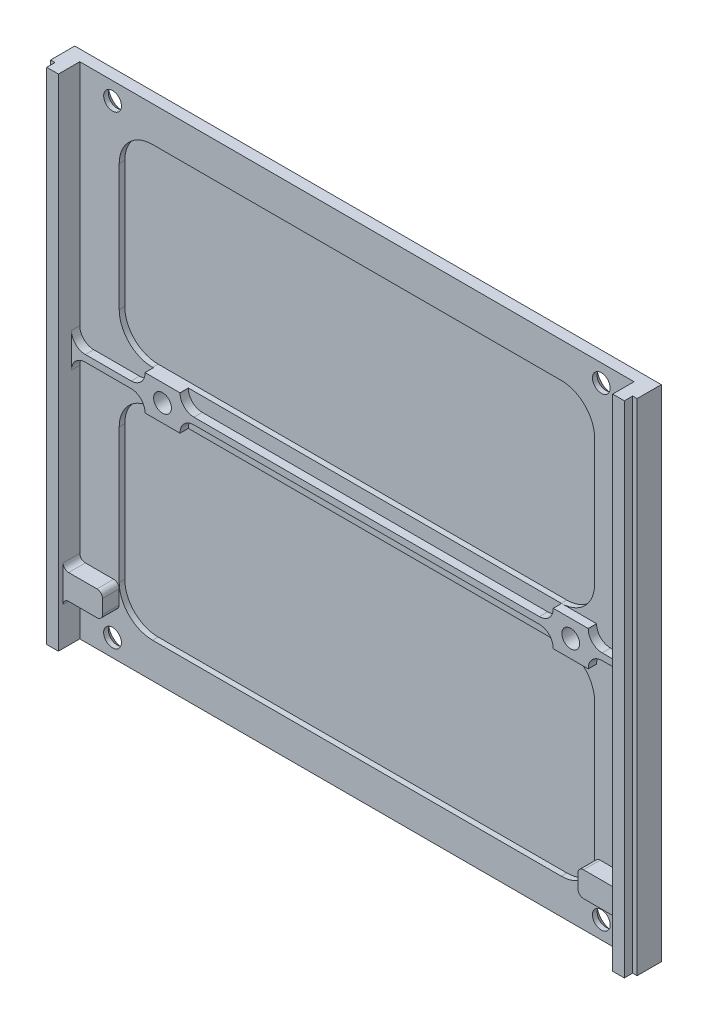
ISO-10303-21;
HEADER;
FILE_DESCRIPTION(('STEP AP214'),'2;1');
FILE_NAME('part.step','',(''),(''),'','','');
FILE_SCHEMA(('AUTOMOTIVE_DESIGN { 1 0 10303 214 1 1 1 1 }'));
ENDSEC;
DATA;
#1=APPLICATION_CONTEXT('core data for automotive mechanical design processes');
#2=APPLICATION_PROTOCOL_DEFINITION('international standard','automotive_design',2000,#1);
#3=PRODUCT_CONTEXT('',#1,'mechanical');
#4=PRODUCT('Part','Part','',(#3));
#5=PRODUCT_RELATED_PRODUCT_CATEGORY('part','',(#4));
#6=PRODUCT_DEFINITION_FORMATION('','',#4);
#7=PRODUCT_DEFINITION_CONTEXT('part definition',#1,'design');
#8=PRODUCT_DEFINITION('design','',#6,#7);
#9=PRODUCT_DEFINITION_SHAPE('','',#8);
#10=(LENGTH_UNIT() NAMED_UNIT(*) SI_UNIT(.MILLI.,.METRE.));
#11=(NAMED_UNIT(*) PLANE_ANGLE_UNIT() SI_UNIT($,.RADIAN.));
#12=(NAMED_UNIT(*) SI_UNIT($,.STERADIAN.) SOLID_ANGLE_UNIT());
#13=UNCERTAINTY_MEASURE_WITH_UNIT(LENGTH_MEASURE(1.E-05),#10,'distance_accuracy_value','');
#14=(GEOMETRIC_REPRESENTATION_CONTEXT(3) GLOBAL_UNCERTAINTY_ASSIGNED_CONTEXT((#13)) GLOBAL_UNIT_ASSIGNED_CONTEXT((#10,
#11,#12)) REPRESENTATION_CONTEXT('',''));
#15=CARTESIAN_POINT('',(0.,0.,0.));
#16=DIRECTION('',(0.,0.,1.));
#17=DIRECTION('',(1.,0.,0.));
#18=AXIS2_PLACEMENT_3D('',#15,#16,#17);
#19=CARTESIAN_POINT('',(-49.9,-45.,2.));
#20=DIRECTION('',(0.,0.,-1.));
#21=DIRECTION('',(-1.,0.,0.));
#22=AXIS2_PLACEMENT_3D('',#19,#20,#21);
#23=PLANE('',#22);
#24=DIRECTION('',(0.,1.,0.));
#25=VECTOR('',#24,1.);
#26=CARTESIAN_POINT('',(-49.9,-45.,2.));
#27=LINE('',#26,#25);
#28=CARTESIAN_POINT('',(-49.9,-31.6500000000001,2.));
#29=VERTEX_POINT('',#28);
#30=CARTESIAN_POINT('',(-49.9,-2.35000000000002,2.));
#31=VERTEX_POINT('',#30);
#32=EDGE_CURVE('E776',#29,#31,#27,.T.);
#33=ORIENTED_EDGE('',*,*,#32,.F.);
#34=CARTESIAN_POINT('',(-48.9,-31.6500000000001,2.));
#35=DIRECTION('',(0.,0.,-1.));
#36=DIRECTION('',(-1.,0.,0.));
#37=AXIS2_PLACEMENT_3D('',#34,#35,#36);
#38=CIRCLE('',#37,1.);
#39=CARTESIAN_POINT('',(-48.9,-32.6500000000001,1.99999999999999));
#40=VERTEX_POINT('',#39);
#41=EDGE_CURVE('E1027',#29,#40,#38,.F.);
#42=ORIENTED_EDGE('',*,*,#41,.T.);
#43=DIRECTION('',(-1.,0.,0.));
#44=VECTOR('',#43,1.);
#45=CARTESIAN_POINT('',(-49.9,-32.6500000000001,1.99999999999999));
#46=LINE('',#45,#44);
#47=CARTESIAN_POINT('',(-43.8,-32.6500000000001,1.99999999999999));
#48=VERTEX_POINT('',#47);
#49=EDGE_CURVE('E1375',#48,#40,#46,.T.);
#50=ORIENTED_EDGE('',*,*,#49,.F.);
#51=CARTESIAN_POINT('',(-43.8,-33.6500000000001,2.));
#52=DIRECTION('',(0.,0.,-1.));
#53=DIRECTION('',(-1.,0.,0.));
#54=AXIS2_PLACEMENT_3D('',#51,#52,#53);
#55=CIRCLE('',#54,1.);
#56=CARTESIAN_POINT('',(-42.8,-33.6500000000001,1.99999999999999));
#57=VERTEX_POINT('',#56);
#58=EDGE_CURVE('E1061',#48,#57,#55,.T.);
#59=ORIENTED_EDGE('',*,*,#58,.T.);
#60=DIRECTION('',(0.,1.,0.));
#61=VECTOR('',#60,1.);
#62=CARTESIAN_POINT('',(-42.8,-37.15,1.99999999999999));
#63=LINE('',#62,#61);
#64=CARTESIAN_POINT('',(-42.8,-36.15,1.99999999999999));
#65=VERTEX_POINT('',#64);
#66=EDGE_CURVE('E57',#65,#57,#63,.T.);
#67=ORIENTED_EDGE('',*,*,#66,.F.);
#68=CARTESIAN_POINT('',(-43.8,-36.15,2.));
#69=DIRECTION('',(0.,0.,-1.));
#70=DIRECTION('',(-1.,0.,0.));
#71=AXIS2_PLACEMENT_3D('',#68,#69,#70);
#72=CIRCLE('',#71,1.);
#73=CARTESIAN_POINT('',(-43.8,-37.15,1.99999999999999));
#74=VERTEX_POINT('',#73);
#75=EDGE_CURVE('E1059',#65,#74,#72,.T.);
#76=ORIENTED_EDGE('',*,*,#75,.T.);
#77=DIRECTION('',(1.,0.,0.));
#78=VECTOR('',#77,1.);
#79=CARTESIAN_POINT('',(-49.9,-37.15,1.99999999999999));
#80=LINE('',#79,#78);
#81=CARTESIAN_POINT('',(-48.9,-37.15,1.99999999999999));
#82=VERTEX_POINT('',#81);
#83=EDGE_CURVE('E1380',#82,#74,#80,.T.);
#84=ORIENTED_EDGE('',*,*,#83,.F.);
#85=CARTESIAN_POINT('',(-48.9,-38.15,2.));
#86=DIRECTION('',(0.,0.,-1.));
#87=DIRECTION('',(-1.,0.,0.));
#88=AXIS2_PLACEMENT_3D('',#85,#86,#87);
#89=CIRCLE('',#88,1.);
#90=CARTESIAN_POINT('',(-49.9,-38.15,2.));
#91=VERTEX_POINT('',#90);
#92=EDGE_CURVE('E1031',#82,#91,#89,.F.);
#93=ORIENTED_EDGE('',*,*,#92,.T.);
#94=CARTESIAN_POINT('',(-49.9,-45.,2.));
#95=VERTEX_POINT('',#94);
#96=EDGE_CURVE('E772',#95,#91,#27,.T.);
#97=ORIENTED_EDGE('',*,*,#96,.F.);
#98=DIRECTION('',(-1.,0.,0.));
#99=VECTOR('',#98,1.);
#100=CARTESIAN_POINT('',(-49.9,-45.,2.));
#101=LINE('',#100,#99);
#102=CARTESIAN_POINT('',(49.9,-45.,1.99999999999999));
#103=VERTEX_POINT('',#102);
#104=EDGE_CURVE('E762',#103,#95,#101,.T.);
#105=ORIENTED_EDGE('',*,*,#104,.F.);
#106=DIRECTION('',(0.,1.,0.));
#107=VECTOR('',#106,1.);
#108=CARTESIAN_POINT('',(49.9,-45.,1.99999999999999));
#109=LINE('',#108,#107);
#110=CARTESIAN_POINT('',(49.9,-38.15,1.99999999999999));
#111=VERTEX_POINT('',#110);
#112=EDGE_CURVE('E778',#103,#111,#109,.T.);
#113=ORIENTED_EDGE('',*,*,#112,.T.);
#114=CARTESIAN_POINT('',(48.9,-38.15,1.99999999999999));
#115=DIRECTION('',(0.,0.,-1.));
#116=DIRECTION('',(-1.,0.,0.));
#117=AXIS2_PLACEMENT_3D('',#114,#115,#116);
#118=CIRCLE('',#117,1.);
#119=CARTESIAN_POINT('',(48.9,-37.15,1.99999999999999));
#120=VERTEX_POINT('',#119);
#121=EDGE_CURVE('E1029',#111,#120,#118,.F.);
#122=ORIENTED_EDGE('',*,*,#121,.T.);
#123=DIRECTION('',(1.,0.,0.));
#124=VECTOR('',#123,1.);
#125=CARTESIAN_POINT('',(49.9,-37.15,1.99999999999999));
#126=LINE('',#125,#124);
#127=CARTESIAN_POINT('',(43.8,-37.15,1.99999999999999));
#128=VERTEX_POINT('',#127);
#129=EDGE_CURVE('E1076',#128,#120,#126,.T.);
#130=ORIENTED_EDGE('',*,*,#129,.F.);
#131=CARTESIAN_POINT('',(43.8,-36.15,1.99999999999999));
#132=DIRECTION('',(0.,0.,-1.));
#133=DIRECTION('',(-1.,0.,0.));
#134=AXIS2_PLACEMENT_3D('',#131,#132,#133);
#135=CIRCLE('',#134,1.);
#136=CARTESIAN_POINT('',(42.8,-36.15,1.99999999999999));
#137=VERTEX_POINT('',#136);
#138=EDGE_CURVE('E42',#128,#137,#135,.T.);
#139=ORIENTED_EDGE('',*,*,#138,.T.);
#140=DIRECTION('',(0.,-1.,0.));
#141=VECTOR('',#140,1.);
#142=CARTESIAN_POINT('',(42.8,-37.15,1.99999999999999));
#143=LINE('',#142,#141);
#144=CARTESIAN_POINT('',(42.8,-33.65,1.99999999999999));
#145=VERTEX_POINT('',#144);
#146=EDGE_CURVE('E1074',#145,#137,#143,.T.);
#147=ORIENTED_EDGE('',*,*,#146,.F.);
#148=CARTESIAN_POINT('',(43.8,-33.65,1.99999999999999));
#149=DIRECTION('',(0.,0.,-1.));
#150=DIRECTION('',(-1.,0.,0.));
#151=AXIS2_PLACEMENT_3D('',#148,#149,#150);
#152=CIRCLE('',#151,1.);
#153=CARTESIAN_POINT('',(43.8,-32.65,1.99999999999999));
#154=VERTEX_POINT('',#153);
#155=EDGE_CURVE('E1070',#145,#154,#152,.T.);
#156=ORIENTED_EDGE('',*,*,#155,.T.);
#157=DIRECTION('',(-1.,0.,0.));
#158=VECTOR('',#157,1.);
#159=CARTESIAN_POINT('',(49.9,-32.65,1.99999999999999));
#160=LINE('',#159,#158);
#161=CARTESIAN_POINT('',(48.9,-32.65,1.99999999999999));
#162=VERTEX_POINT('',#161);
#163=EDGE_CURVE('E49',#162,#154,#160,.T.);
#164=ORIENTED_EDGE('',*,*,#163,.F.);
#165=CARTESIAN_POINT('',(48.9,-31.65,1.99999999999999));
#166=DIRECTION('',(0.,0.,-1.));
#167=DIRECTION('',(-1.,0.,0.));
#168=AXIS2_PLACEMENT_3D('',#165,#166,#167);
#169=CIRCLE('',#168,1.);
#170=CARTESIAN_POINT('',(49.9,-31.65,1.99999999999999));
#171=VERTEX_POINT('',#170);
#172=EDGE_CURVE('E1037',#162,#171,#169,.F.);
#173=ORIENTED_EDGE('',*,*,#172,.T.);
#174=CARTESIAN_POINT('',(49.9,-2.35000000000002,1.99999999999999));
#175=VERTEX_POINT('',#174);
#176=EDGE_CURVE('E781',#171,#175,#109,.T.);
#177=ORIENTED_EDGE('',*,*,#176,.T.);
#178=CARTESIAN_POINT('',(47.4,-2.35,1.99999999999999));
#179=DIRECTION('',(0.,0.,-1.));
#180=DIRECTION('',(-1.,0.,0.));
#181=AXIS2_PLACEMENT_3D('',#178,#179,#180);
#182=CIRCLE('',#181,2.5);
#183=CARTESIAN_POINT('',(47.4,0.149999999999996,1.99999999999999));
#184=VERTEX_POINT('',#183);
#185=EDGE_CURVE('E885',#175,#184,#182,.F.);
#186=ORIENTED_EDGE('',*,*,#185,.T.);
#187=DIRECTION('',(1.,0.,0.));
#188=VECTOR('',#187,1.);
#189=CARTESIAN_POINT('',(43.15,0.149999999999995,1.99999999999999));
#190=LINE('',#189,#188);
#191=CARTESIAN_POINT('',(45.65,0.149999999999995,1.99999999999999));
#192=VERTEX_POINT('',#191);
#193=EDGE_CURVE('E675',#192,#184,#190,.T.);
#194=ORIENTED_EDGE('',*,*,#193,.F.);
#195=CARTESIAN_POINT('',(45.65,-2.35,1.99999999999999));
#196=DIRECTION('',(0.,0.,-1.));
#197=DIRECTION('',(-1.,0.,0.));
#198=AXIS2_PLACEMENT_3D('',#195,#196,#197);
#199=CIRCLE('',#198,2.5);
#200=CARTESIAN_POINT('',(43.15,-2.35,1.99999999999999));
#201=VERTEX_POINT('',#200);
#202=EDGE_CURVE('E887',#192,#201,#199,.F.);
#203=ORIENTED_EDGE('',*,*,#202,.T.);
#204=DIRECTION('',(0.,1.,0.));
#205=VECTOR('',#204,1.);
#206=CARTESIAN_POINT('',(43.15,-2.40000000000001,1.99999999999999));
#207=LINE('',#206,#205);
#208=CARTESIAN_POINT('',(43.15,-2.40000000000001,1.99999999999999));
#209=VERTEX_POINT('',#208);
#210=EDGE_CURVE('E672',#209,#201,#207,.T.);
#211=ORIENTED_EDGE('',*,*,#210,.F.);
#212=DIRECTION('',(1.,0.,0.));
#213=VECTOR('',#212,1.);
#214=CARTESIAN_POINT('',(36.85,-2.40000000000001,1.99999999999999));
#215=LINE('',#214,#213);
#216=CARTESIAN_POINT('',(36.85,-2.40000000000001,1.99999999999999));
#217=VERTEX_POINT('',#216);
#218=EDGE_CURVE('E670',#217,#209,#215,.T.);
#219=ORIENTED_EDGE('',*,*,#218,.F.);
#220=DIRECTION('',(-1.,0.,0.));
#221=VECTOR('',#220,1.);
#222=CARTESIAN_POINT('',(-42.8,-2.40000000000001,1.99999999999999));
#223=LINE('',#222,#221);
#224=CARTESIAN_POINT('',(36.8,-2.40000000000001,1.99999999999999));
#225=VERTEX_POINT('',#224);
#226=EDGE_CURVE('E543',#217,#225,#223,.T.);
#227=ORIENTED_EDGE('',*,*,#226,.T.);
#228=CARTESIAN_POINT('',(36.8,-8.40000000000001,1.99999999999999));
#229=DIRECTION('',(0.,0.,-1.));
#230=DIRECTION('',(-1.,0.,0.));
#231=AXIS2_PLACEMENT_3D('',#228,#229,#230);
#232=CIRCLE('',#231,6.);
#233=CARTESIAN_POINT('',(42.8,-8.40000000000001,1.99999999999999));
#234=VERTEX_POINT('',#233);
#235=EDGE_CURVE('E536',#225,#234,#232,.T.);
#236=ORIENTED_EDGE('',*,*,#235,.T.);
#237=DIRECTION('',(0.,1.,0.));
#238=VECTOR('',#237,1.);
#239=CARTESIAN_POINT('',(42.8,-38.65,1.99999999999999));
#240=LINE('',#239,#238);
#241=CARTESIAN_POINT('',(42.8,-32.65,1.99999999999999));
#242=VERTEX_POINT('',#241);
#243=EDGE_CURVE('E526',#242,#234,#240,.T.);
#244=ORIENTED_EDGE('',*,*,#243,.F.);
#245=CARTESIAN_POINT('',(36.8,-32.65,1.99999999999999));
#246=DIRECTION('',(0.,0.,-1.));
#247=DIRECTION('',(-1.,0.,0.));
#248=AXIS2_PLACEMENT_3D('',#245,#246,#247);
#249=CIRCLE('',#248,6.);
#250=CARTESIAN_POINT('',(36.8,-38.65,1.99999999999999));
#251=VERTEX_POINT('',#250);
#252=EDGE_CURVE('E509',#242,#251,#249,.T.);
#253=ORIENTED_EDGE('',*,*,#252,.T.);
#254=DIRECTION('',(1.,0.,0.));
#255=VECTOR('',#254,1.);
#256=CARTESIAN_POINT('',(-42.8,-38.65,1.99999999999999));
#257=LINE('',#256,#255);
#258=CARTESIAN_POINT('',(-36.8,-38.65,1.99999999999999));
#259=VERTEX_POINT('',#258);
#260=EDGE_CURVE('E553',#259,#251,#257,.T.);
#261=ORIENTED_EDGE('',*,*,#260,.F.);
#262=CARTESIAN_POINT('',(-36.8,-32.65,2.));
#263=DIRECTION('',(0.,0.,-1.));
#264=DIRECTION('',(-1.,0.,0.));
#265=AXIS2_PLACEMENT_3D('',#262,#263,#264);
#266=CIRCLE('',#265,6.);
#267=CARTESIAN_POINT('',(-42.8,-32.65,1.99999999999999));
#268=VERTEX_POINT('',#267);
#269=EDGE_CURVE('E520',#259,#268,#266,.T.);
#270=ORIENTED_EDGE('',*,*,#269,.T.);
#271=DIRECTION('',(0.,-1.,0.));
#272=VECTOR('',#271,1.);
#273=CARTESIAN_POINT('',(-42.8,-38.65,1.99999999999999));
#274=LINE('',#273,#272);
#275=CARTESIAN_POINT('',(-42.8,-8.40000000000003,1.99999999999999));
#276=VERTEX_POINT('',#275);
#277=EDGE_CURVE('E1131',#276,#268,#274,.T.);
#278=ORIENTED_EDGE('',*,*,#277,.F.);
#279=CARTESIAN_POINT('',(-36.8,-8.40000000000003,2.));
#280=DIRECTION('',(0.,0.,-1.));
#281=DIRECTION('',(-1.,0.,0.));
#282=AXIS2_PLACEMENT_3D('',#279,#280,#281);
#283=CIRCLE('',#282,6.);
#284=CARTESIAN_POINT('',(-36.8,-2.40000000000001,1.99999999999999));
#285=VERTEX_POINT('',#284);
#286=EDGE_CURVE('E872',#276,#285,#283,.T.);
#287=ORIENTED_EDGE('',*,*,#286,.T.);
#288=CARTESIAN_POINT('',(-36.65,-2.40000000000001,1.99999999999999));
#289=VERTEX_POINT('',#288);
#290=EDGE_CURVE('E537',#289,#285,#223,.T.);
#291=ORIENTED_EDGE('',*,*,#290,.F.);
#292=DIRECTION('',(0.,-1.,0.));
#293=VECTOR('',#292,1.);
#294=CARTESIAN_POINT('',(-36.65,-2.40000000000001,1.99999999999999));
#295=LINE('',#294,#293);
#296=CARTESIAN_POINT('',(-36.65,-2.35,1.99999999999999));
#297=VERTEX_POINT('',#296);
#298=EDGE_CURVE('E660',#297,#289,#295,.T.);
#299=ORIENTED_EDGE('',*,*,#298,.F.);
#300=CARTESIAN_POINT('',(-39.15,-2.35,2.));
#301=DIRECTION('',(0.,0.,-1.));
#302=DIRECTION('',(-1.,0.,0.));
#303=AXIS2_PLACEMENT_3D('',#300,#301,#302);
#304=CIRCLE('',#303,2.5);
#305=CARTESIAN_POINT('',(-39.15,0.149999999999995,1.99999999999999));
#306=VERTEX_POINT('',#305);
#307=EDGE_CURVE('E889',#297,#306,#304,.F.);
#308=ORIENTED_EDGE('',*,*,#307,.T.);
#309=DIRECTION('',(1.,0.,0.));
#310=VECTOR('',#309,1.);
#311=CARTESIAN_POINT('',(-36.65,0.149999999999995,1.99999999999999));
#312=LINE('',#311,#310);
#313=CARTESIAN_POINT('',(-47.4,0.149999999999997,1.99999999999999));
#314=VERTEX_POINT('',#313);
#315=EDGE_CURVE('E657',#314,#306,#312,.T.);
#316=ORIENTED_EDGE('',*,*,#315,.F.);
#317=CARTESIAN_POINT('',(-47.4,-2.35,2.));
#318=DIRECTION('',(0.,0.,-1.));
#319=DIRECTION('',(-1.,0.,0.));
#320=AXIS2_PLACEMENT_3D('',#317,#318,#319);
#321=CIRCLE('',#320,2.5);
#322=EDGE_CURVE('E891',#314,#31,#321,.F.);
#323=ORIENTED_EDGE('',*,*,#322,.T.);
#324=EDGE_LOOP('',(#33,#42,#50,#59,#67,#76,#84,#93,#97,#105,#113,#122,#130,#139,#147,#156,#164,
#173,#177,#186,#194,#203,#211,#219,#227,#236,#244,#253,#261,#270,#278,#287,#291,#299,#308,#316,#323));
#325=FACE_BOUND('',#324,.T.);
#326=CARTESIAN_POINT('',(44.,-41.85,1.99999999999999));
#327=DIRECTION('',(0.,0.,-1.));
#328=DIRECTION('',(-1.,0.,0.));
#329=AXIS2_PLACEMENT_3D('',#326,#327,#328);
#330=CIRCLE('',#329,1.6);
#331=CARTESIAN_POINT('',(42.4,-41.85,1.99999999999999));
#332=VERTEX_POINT('',#331);
#333=EDGE_CURVE('E589',#332,#332,#330,.T.);
#334=ORIENTED_EDGE('',*,*,#333,.T.);
#335=EDGE_LOOP('',(#334));
#336=FACE_BOUND('',#335,.T.);
#337=CARTESIAN_POINT('',(-44.,-41.85,2.));
#338=DIRECTION('',(0.,0.,-1.));
#339=DIRECTION('',(-1.,0.,0.));
#340=AXIS2_PLACEMENT_3D('',#337,#338,#339);
#341=CIRCLE('',#340,1.6);
#342=CARTESIAN_POINT('',(-45.6,-41.85,2.));
#343=VERTEX_POINT('',#342);
#344=EDGE_CURVE('E592',#343,#343,#341,.T.);
#345=ORIENTED_EDGE('',*,*,#344,.T.);
#346=EDGE_LOOP('',(#345));
#347=FACE_BOUND('',#346,.T.);
#348=ADVANCED_FACE('F34',(#325,#336,#347),#23,.F.);
#349=CARTESIAN_POINT('',(-49.9,-45.,2.));
#350=DIRECTION('',(-1.,0.,0.));
#351=DIRECTION('',(0.,0.,1.));
#352=AXIS2_PLACEMENT_3D('',#349,#350,#351);
#353=PLANE('',#352);
#354=DIRECTION('',(0.,-1.,0.));
#355=VECTOR('',#354,1.);
#356=CARTESIAN_POINT('',(-49.9,-37.15,4.99999999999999));
#357=LINE('',#356,#355);
#358=CARTESIAN_POINT('',(-49.9,-31.6500000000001,4.99999999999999));
#359=VERTEX_POINT('',#358);
#360=CARTESIAN_POINT('',(-49.9,-38.15,4.99999999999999));
#361=VERTEX_POINT('',#360);
#362=EDGE_CURVE('E1378',#359,#361,#357,.T.);
#363=ORIENTED_EDGE('',*,*,#362,.F.);
#364=DIRECTION('',(0.,0.,-1.));
#365=VECTOR('',#364,1.);
#366=CARTESIAN_POINT('',(-49.9,-31.6500000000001,2.));
#367=LINE('',#366,#365);
#368=EDGE_CURVE('E1024',#359,#29,#367,.T.);
#369=ORIENTED_EDGE('',*,*,#368,.T.);
#370=ORIENTED_EDGE('',*,*,#32,.T.);
#371=DIRECTION('',(0.,0.,-1.));
#372=VECTOR('',#371,1.);
#373=CARTESIAN_POINT('',(-49.9,-2.35,3.5));
#374=LINE('',#373,#372);
#375=CARTESIAN_POINT('',(-49.9,-2.35,3.5));
#376=VERTEX_POINT('',#375);
#377=EDGE_CURVE('E896',#31,#376,#374,.F.);
#378=ORIENTED_EDGE('',*,*,#377,.T.);
#379=DIRECTION('',(0.,-1.,0.));
#380=VECTOR('',#379,1.);
#381=CARTESIAN_POINT('',(-49.9,-45.,3.5));
#382=LINE('',#381,#380);
#383=CARTESIAN_POINT('',(-49.9,3.84999999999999,3.5));
#384=VERTEX_POINT('',#383);
#385=EDGE_CURVE('E647',#384,#376,#382,.T.);
#386=ORIENTED_EDGE('',*,*,#385,.F.);
#387=DIRECTION('',(0.,0.,1.));
#388=VECTOR('',#387,1.);
#389=CARTESIAN_POINT('',(-49.9,3.84999999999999,2.));
#390=LINE('',#389,#388);
#391=CARTESIAN_POINT('',(-49.9,3.84999999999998,2.));
#392=VERTEX_POINT('',#391);
#393=EDGE_CURVE('E894',#384,#392,#390,.F.);
#394=ORIENTED_EDGE('',*,*,#393,.T.);
#395=CARTESIAN_POINT('',(-49.9,45.,2.));
#396=VERTEX_POINT('',#395);
#397=EDGE_CURVE('E777',#392,#396,#27,.T.);
#398=ORIENTED_EDGE('',*,*,#397,.T.);
#399=DIRECTION('',(0.,0.,1.));
#400=VECTOR('',#399,1.);
#401=CARTESIAN_POINT('',(-49.9,45.,2.));
#402=LINE('',#401,#400);
#403=CARTESIAN_POINT('',(-49.9,45.,5.85000000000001));
#404=VERTEX_POINT('',#403);
#405=EDGE_CURVE('E751',#396,#404,#402,.T.);
#406=ORIENTED_EDGE('',*,*,#405,.T.);
#407=DIRECTION('',(0.,1.,0.));
#408=VECTOR('',#407,1.);
#409=CARTESIAN_POINT('',(-49.9,-45.,5.85000000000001));
#410=LINE('',#409,#408);
#411=CARTESIAN_POINT('',(-49.9,-45.,5.85000000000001));
#412=VERTEX_POINT('',#411);
#413=EDGE_CURVE('E765',#412,#404,#410,.T.);
#414=ORIENTED_EDGE('',*,*,#413,.F.);
#415=DIRECTION('',(0.,0.,1.));
#416=VECTOR('',#415,1.);
#417=CARTESIAN_POINT('',(-49.9,-45.,2.));
#418=LINE('',#417,#416);
#419=EDGE_CURVE('E755',#95,#412,#418,.T.);
#420=ORIENTED_EDGE('',*,*,#419,.F.);
#421=ORIENTED_EDGE('',*,*,#96,.T.);
#422=DIRECTION('',(0.,0.,-1.));
#423=VECTOR('',#422,1.);
#424=CARTESIAN_POINT('',(-49.9,-38.15,4.99999999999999));
#425=LINE('',#424,#423);
#426=EDGE_CURVE('E1021',#91,#361,#425,.F.);
#427=ORIENTED_EDGE('',*,*,#426,.T.);
#428=EDGE_LOOP('',(#363,#369,#370,#378,#386,#394,#398,#406,#414,#420,#421,#427));
#429=FACE_BOUND('',#428,.T.);
#430=ADVANCED_FACE('F1194',(#429),#353,.F.);
#431=CARTESIAN_POINT('',(49.9,-45.,1.99999999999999));
#432=DIRECTION('',(1.,0.,0.));
#433=DIRECTION('',(0.,0.,-1.));
#434=AXIS2_PLACEMENT_3D('',#431,#432,#433);
#435=PLANE('',#434);
#436=ORIENTED_EDGE('',*,*,#176,.F.);
#437=DIRECTION('',(0.,0.,-1.));
#438=VECTOR('',#437,1.);
#439=CARTESIAN_POINT('',(49.9,-31.65,4.99999999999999));
#440=LINE('',#439,#438);
#441=CARTESIAN_POINT('',(49.9,-31.65,4.99999999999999));
#442=VERTEX_POINT('',#441);
#443=EDGE_CURVE('E1042',#171,#442,#440,.F.);
#444=ORIENTED_EDGE('',*,*,#443,.T.);
#445=DIRECTION('',(0.,1.,0.));
#446=VECTOR('',#445,1.);
#447=CARTESIAN_POINT('',(49.9,-37.15,4.99999999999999));
#448=LINE('',#447,#446);
#449=CARTESIAN_POINT('',(49.9,-38.15,4.99999999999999));
#450=VERTEX_POINT('',#449);
#451=EDGE_CURVE('E1110',#450,#442,#448,.T.);
#452=ORIENTED_EDGE('',*,*,#451,.F.);
#453=DIRECTION('',(0.,0.,-1.));
#454=VECTOR('',#453,1.);
#455=CARTESIAN_POINT('',(49.9,-38.15,1.99999999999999));
#456=LINE('',#455,#454);
#457=EDGE_CURVE('E1039',#450,#111,#456,.T.);
#458=ORIENTED_EDGE('',*,*,#457,.T.);
#459=ORIENTED_EDGE('',*,*,#112,.F.);
#460=DIRECTION('',(0.,0.,-1.));
#461=VECTOR('',#460,1.);
#462=CARTESIAN_POINT('',(49.9,-45.,1.99999999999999));
#463=LINE('',#462,#461);
#464=CARTESIAN_POINT('',(49.9,-45.,5.85));
#465=VERTEX_POINT('',#464);
#466=EDGE_CURVE('E758',#465,#103,#463,.T.);
#467=ORIENTED_EDGE('',*,*,#466,.F.);
#468=DIRECTION('',(0.,1.,0.));
#469=VECTOR('',#468,1.);
#470=CARTESIAN_POINT('',(49.9,-45.,5.85));
#471=LINE('',#470,#469);
#472=CARTESIAN_POINT('',(49.9,45.,5.85));
#473=VERTEX_POINT('',#472);
#474=EDGE_CURVE('E783',#465,#473,#471,.T.);
#475=ORIENTED_EDGE('',*,*,#474,.T.);
#476=DIRECTION('',(0.,0.,-1.));
#477=VECTOR('',#476,1.);
#478=CARTESIAN_POINT('',(49.9,45.,1.99999999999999));
#479=LINE('',#478,#477);
#480=CARTESIAN_POINT('',(49.9,45.,1.99999999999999));
#481=VERTEX_POINT('',#480);
#482=EDGE_CURVE('E767',#473,#481,#479,.T.);
#483=ORIENTED_EDGE('',*,*,#482,.T.);
#484=CARTESIAN_POINT('',(49.9,3.84999999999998,1.99999999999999));
#485=VERTEX_POINT('',#484);
#486=EDGE_CURVE('E782',#485,#481,#109,.T.);
#487=ORIENTED_EDGE('',*,*,#486,.F.);
#488=DIRECTION('',(0.,0.,-1.));
#489=VECTOR('',#488,1.);
#490=CARTESIAN_POINT('',(49.9,3.84999999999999,3.5));
#491=LINE('',#490,#489);
#492=CARTESIAN_POINT('',(49.9,3.84999999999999,3.5));
#493=VERTEX_POINT('',#492);
#494=EDGE_CURVE('E915',#485,#493,#491,.F.);
#495=ORIENTED_EDGE('',*,*,#494,.T.);
#496=DIRECTION('',(0.,1.,0.));
#497=VECTOR('',#496,1.);
#498=CARTESIAN_POINT('',(49.9,-45.,3.5));
#499=LINE('',#498,#497);
#500=CARTESIAN_POINT('',(49.9,-2.35,3.5));
#501=VERTEX_POINT('',#500);
#502=EDGE_CURVE('E813',#501,#493,#499,.T.);
#503=ORIENTED_EDGE('',*,*,#502,.F.);
#504=DIRECTION('',(0.,0.,1.));
#505=VECTOR('',#504,1.);
#506=CARTESIAN_POINT('',(49.9,-2.35,1.99999999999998));
#507=LINE('',#506,#505);
#508=EDGE_CURVE('E912',#501,#175,#507,.F.);
#509=ORIENTED_EDGE('',*,*,#508,.T.);
#510=EDGE_LOOP('',(#436,#444,#452,#458,#459,#467,#475,#483,#487,#495,#503,#509));
#511=FACE_BOUND('',#510,.T.);
#512=ADVANCED_FACE('F1200',(#511),#435,.F.);
#513=CARTESIAN_POINT('',(36.85,-2.40000000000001,110.040642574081));
#514=DIRECTION('',(0.,1.,0.));
#515=DIRECTION('',(-1.,0.,0.));
#516=AXIS2_PLACEMENT_3D('',#513,#514,#515);
#517=PLANE('',#516);
#518=DIRECTION('',(-1.,0.,0.));
#519=VECTOR('',#518,1.);
#520=CARTESIAN_POINT('',(-42.8,-2.40000000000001,1.));
#521=LINE('',#520,#519);
#522=CARTESIAN_POINT('',(36.8,-2.40000000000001,1.));
#523=VERTEX_POINT('',#522);
#524=CARTESIAN_POINT('',(-36.8,-2.40000000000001,1.));
#525=VERTEX_POINT('',#524);
#526=EDGE_CURVE('E549',#523,#525,#521,.T.);
#527=ORIENTED_EDGE('',*,*,#526,.F.);
#528=DIRECTION('',(0.,0.,1.));
#529=VECTOR('',#528,1.);
#530=CARTESIAN_POINT('',(36.8,-2.40000000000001,1.99999999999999));
#531=LINE('',#530,#529);
#532=EDGE_CURVE('E531',#523,#225,#531,.T.);
#533=ORIENTED_EDGE('',*,*,#532,.T.);
#534=CARTESIAN_POINT('',(-30.35,-2.40000000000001,2.));
#535=VERTEX_POINT('',#534);
#536=EDGE_CURVE('E541',#225,#535,#223,.T.);
#537=ORIENTED_EDGE('',*,*,#536,.T.);
#538=DIRECTION('',(0.,0.,-1.));
#539=VECTOR('',#538,1.);
#540=CARTESIAN_POINT('',(-30.35,-2.40000000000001,110.040642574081));
#541=LINE('',#540,#539);
#542=CARTESIAN_POINT('',(-30.35,-2.40000000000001,3.5));
#543=VERTEX_POINT('',#542);
#544=EDGE_CURVE('E703',#543,#535,#541,.T.);
#545=ORIENTED_EDGE('',*,*,#544,.F.);
#546=DIRECTION('',(-1.,0.,0.));
#547=VECTOR('',#546,1.);
#548=CARTESIAN_POINT('',(-36.65,-2.40000000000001,3.5));
#549=LINE('',#548,#547);
#550=CARTESIAN_POINT('',(-36.65,-2.40000000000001,3.5));
#551=VERTEX_POINT('',#550);
#552=EDGE_CURVE('E627',#543,#551,#549,.T.);
#553=ORIENTED_EDGE('',*,*,#552,.T.);
#554=DIRECTION('',(0.,0.,-1.));
#555=VECTOR('',#554,1.);
#556=CARTESIAN_POINT('',(-36.65,-2.40000000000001,110.040642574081));
#557=LINE('',#556,#555);
#558=EDGE_CURVE('E706',#551,#289,#557,.T.);
#559=ORIENTED_EDGE('',*,*,#558,.T.);
#560=ORIENTED_EDGE('',*,*,#290,.T.);
#561=DIRECTION('',(0.,0.,1.));
#562=VECTOR('',#561,1.);
#563=CARTESIAN_POINT('',(-36.8,-2.40000000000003,1.));
#564=LINE('',#563,#562);
#565=EDGE_CURVE('E837',#285,#525,#564,.F.);
#566=ORIENTED_EDGE('',*,*,#565,.T.);
#567=EDGE_LOOP('',(#527,#533,#537,#545,#553,#559,#560,#566));
#568=FACE_BOUND('',#567,.T.);
#569=ADVANCED_FACE('F1143',(#568),#517,.F.);
#570=CARTESIAN_POINT('',(36.85,3.89999999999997,110.040642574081));
#571=DIRECTION('',(0.,-1.,0.));
#572=DIRECTION('',(1.,0.,0.));
#573=AXIS2_PLACEMENT_3D('',#570,#571,#572);
#574=PLANE('',#573);
#575=DIRECTION('',(-1.,0.,0.));
#576=VECTOR('',#575,1.);
#577=CARTESIAN_POINT('',(36.85,3.89999999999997,1.99999999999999));
#578=LINE('',#577,#576);
#579=CARTESIAN_POINT('',(43.15,3.89999999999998,1.99999999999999));
#580=VERTEX_POINT('',#579);
#581=CARTESIAN_POINT('',(36.85,3.89999999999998,1.99999999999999));
#582=VERTEX_POINT('',#581);
#583=EDGE_CURVE('E683',#580,#582,#578,.T.);
#584=ORIENTED_EDGE('',*,*,#583,.T.);
#585=DIRECTION('',(0.,0.,-1.));
#586=VECTOR('',#585,1.);
#587=CARTESIAN_POINT('',(36.85,3.89999999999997,110.040642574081));
#588=LINE('',#587,#586);
#589=CARTESIAN_POINT('',(36.85,3.89999999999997,3.5));
#590=VERTEX_POINT('',#589);
#591=EDGE_CURVE('E691',#590,#582,#588,.T.);
#592=ORIENTED_EDGE('',*,*,#591,.F.);
#593=DIRECTION('',(1.,0.,0.));
#594=VECTOR('',#593,1.);
#595=CARTESIAN_POINT('',(36.85,3.89999999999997,3.5));
#596=LINE('',#595,#594);
#597=CARTESIAN_POINT('',(43.15,3.89999999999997,3.5));
#598=VERTEX_POINT('',#597);
#599=EDGE_CURVE('E601',#590,#598,#596,.T.);
#600=ORIENTED_EDGE('',*,*,#599,.T.);
#601=DIRECTION('',(0.,0.,-1.));
#602=VECTOR('',#601,1.);
#603=CARTESIAN_POINT('',(43.15,3.89999999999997,110.040642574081));
#604=LINE('',#603,#602);
#605=EDGE_CURVE('E694',#598,#580,#604,.T.);
#606=ORIENTED_EDGE('',*,*,#605,.T.);
#607=EDGE_LOOP('',(#584,#592,#600,#606));
#608=FACE_BOUND('',#607,.T.);
#609=ADVANCED_FACE('F1207',(#608),#574,.F.);
#610=DIRECTION('',(1.,0.,0.));
#611=VECTOR('',#610,1.);
#612=CARTESIAN_POINT('',(-30.35,0.149999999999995,1.99999999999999));
#613=LINE('',#612,#611);
#614=CARTESIAN_POINT('',(-27.85,0.149999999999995,1.99999999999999));
#615=VERTEX_POINT('',#614);
#616=CARTESIAN_POINT('',(34.35,0.149999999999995,1.99999999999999));
#617=VERTEX_POINT('',#616);
#618=EDGE_CURVE('E665',#615,#617,#613,.T.);
#619=ORIENTED_EDGE('',*,*,#618,.F.);
#620=CARTESIAN_POINT('',(-27.85,-2.35000000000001,2.));
#621=DIRECTION('',(0.,0.,-1.));
#622=DIRECTION('',(-1.,0.,0.));
#623=AXIS2_PLACEMENT_3D('',#620,#621,#622);
#624=CIRCLE('',#623,2.5);
#625=CARTESIAN_POINT('',(-30.35,-2.35000000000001,1.99999999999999));
#626=VERTEX_POINT('',#625);
#627=EDGE_CURVE('E931',#615,#626,#624,.F.);
#628=ORIENTED_EDGE('',*,*,#627,.T.);
#629=DIRECTION('',(0.,1.,0.));
#630=VECTOR('',#629,1.);
#631=CARTESIAN_POINT('',(-30.35,-2.40000000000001,1.99999999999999));
#632=LINE('',#631,#630);
#633=EDGE_CURVE('E662',#535,#626,#632,.T.);
#634=ORIENTED_EDGE('',*,*,#633,.F.);
#635=ORIENTED_EDGE('',*,*,#536,.F.);
#636=ORIENTED_EDGE('',*,*,#226,.F.);
#637=DIRECTION('',(0.,-1.,0.));
#638=VECTOR('',#637,1.);
#639=CARTESIAN_POINT('',(36.85,-2.40000000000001,1.99999999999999));
#640=LINE('',#639,#638);
#641=CARTESIAN_POINT('',(36.85,-2.35,1.99999999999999));
#642=VERTEX_POINT('',#641);
#643=EDGE_CURVE('E668',#642,#217,#640,.T.);
#644=ORIENTED_EDGE('',*,*,#643,.F.);
#645=CARTESIAN_POINT('',(34.35,-2.35000000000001,1.99999999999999));
#646=DIRECTION('',(0.,0.,-1.));
#647=DIRECTION('',(-1.,0.,0.));
#648=AXIS2_PLACEMENT_3D('',#645,#646,#647);
#649=CIRCLE('',#648,2.5);
#650=EDGE_CURVE('E929',#642,#617,#649,.F.);
#651=ORIENTED_EDGE('',*,*,#650,.T.);
#652=EDGE_LOOP('',(#619,#628,#634,#635,#636,#644,#651));
#653=FACE_BOUND('',#652,.T.);
#654=ADVANCED_FACE('F1147',(#653),#23,.F.);
#655=DIRECTION('',(0.,1.,0.));
#656=VECTOR('',#655,1.);
#657=CARTESIAN_POINT('',(-30.35,1.34999999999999,1.99999999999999));
#658=LINE('',#657,#656);
#659=CARTESIAN_POINT('',(-30.35,3.84999999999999,1.99999999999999));
#660=VERTEX_POINT('',#659);
#661=CARTESIAN_POINT('',(-30.35,3.89999999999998,1.99999999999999));
#662=VERTEX_POINT('',#661);
#663=EDGE_CURVE('E648',#660,#662,#658,.T.);
#664=ORIENTED_EDGE('',*,*,#663,.F.);
#665=CARTESIAN_POINT('',(-27.85,3.84999999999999,2.));
#666=DIRECTION('',(0.,0.,-1.));
#667=DIRECTION('',(-1.,0.,0.));
#668=AXIS2_PLACEMENT_3D('',#665,#666,#667);
#669=CIRCLE('',#668,2.5);
#670=CARTESIAN_POINT('',(-27.85,1.34999999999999,1.99999999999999));
#671=VERTEX_POINT('',#670);
#672=EDGE_CURVE('E945',#660,#671,#669,.F.);
#673=ORIENTED_EDGE('',*,*,#672,.T.);
#674=DIRECTION('',(-1.,0.,0.));
#675=VECTOR('',#674,1.);
#676=CARTESIAN_POINT('',(-30.35,1.34999999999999,1.99999999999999));
#677=LINE('',#676,#675);
#678=CARTESIAN_POINT('',(34.35,1.34999999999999,1.99999999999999));
#679=VERTEX_POINT('',#678);
#680=EDGE_CURVE('E688',#679,#671,#677,.T.);
#681=ORIENTED_EDGE('',*,*,#680,.F.);
#682=CARTESIAN_POINT('',(34.35,3.84999999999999,1.99999999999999));
#683=DIRECTION('',(0.,0.,-1.));
#684=DIRECTION('',(-1.,0.,0.));
#685=AXIS2_PLACEMENT_3D('',#682,#683,#684);
#686=CIRCLE('',#685,2.5);
#687=CARTESIAN_POINT('',(36.85,3.84999999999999,1.99999999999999));
#688=VERTEX_POINT('',#687);
#689=EDGE_CURVE('E943',#679,#688,#686,.F.);
#690=ORIENTED_EDGE('',*,*,#689,.T.);
#691=DIRECTION('',(0.,-1.,0.));
#692=VECTOR('',#691,1.);
#693=CARTESIAN_POINT('',(36.85,1.34999999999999,1.99999999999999));
#694=LINE('',#693,#692);
#695=EDGE_CURVE('E685',#582,#688,#694,.T.);
#696=ORIENTED_EDGE('',*,*,#695,.F.);
#697=DIRECTION('',(1.,0.,0.));
#698=VECTOR('',#697,1.);
#699=CARTESIAN_POINT('',(-42.8,3.89999999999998,1.99999999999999));
#700=LINE('',#699,#698);
#701=CARTESIAN_POINT('',(36.8,3.89999999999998,1.99999999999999));
#702=VERTEX_POINT('',#701);
#703=EDGE_CURVE('E561',#702,#582,#700,.T.);
#704=ORIENTED_EDGE('',*,*,#703,.F.);
#705=EDGE_CURVE('E564',#662,#702,#700,.T.);
#706=ORIENTED_EDGE('',*,*,#705,.F.);
#707=EDGE_LOOP('',(#664,#673,#681,#690,#696,#704,#706));
#708=FACE_BOUND('',#707,.T.);
#709=ADVANCED_FACE('F1206',(#708),#23,.F.);
#710=CARTESIAN_POINT('',(44.,41.85,1.99999999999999));
#711=DIRECTION('',(0.,0.,-1.));
#712=DIRECTION('',(-1.,0.,0.));
#713=AXIS2_PLACEMENT_3D('',#710,#711,#712);
#714=CIRCLE('',#713,1.6);
#715=CARTESIAN_POINT('',(42.4,41.85,1.99999999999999));
#716=VERTEX_POINT('',#715);
#717=EDGE_CURVE('E581',#716,#716,#714,.T.);
#718=ORIENTED_EDGE('',*,*,#717,.T.);
#719=EDGE_LOOP('',(#718));
#720=FACE_BOUND('',#719,.T.);
#721=CARTESIAN_POINT('',(-44.,41.85,2.));
#722=DIRECTION('',(0.,0.,-1.));
#723=DIRECTION('',(-1.,0.,0.));
#724=AXIS2_PLACEMENT_3D('',#721,#722,#723);
#725=CIRCLE('',#724,1.6);
#726=CARTESIAN_POINT('',(-45.6,41.85,2.));
#727=VERTEX_POINT('',#726);
#728=EDGE_CURVE('E595',#727,#727,#725,.T.);
#729=ORIENTED_EDGE('',*,*,#728,.T.);
#730=EDGE_LOOP('',(#729));
#731=FACE_BOUND('',#730,.T.);
#732=DIRECTION('',(-1.,0.,0.));
#733=VECTOR('',#732,1.);
#734=CARTESIAN_POINT('',(43.15,1.34999999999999,1.99999999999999));
#735=LINE('',#734,#733);
#736=CARTESIAN_POINT('',(47.4,1.34999999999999,1.99999999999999));
#737=VERTEX_POINT('',#736);
#738=CARTESIAN_POINT('',(45.65,1.34999999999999,1.99999999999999));
#739=VERTEX_POINT('',#738);
#740=EDGE_CURVE('E678',#737,#739,#735,.T.);
#741=ORIENTED_EDGE('',*,*,#740,.F.);
#742=CARTESIAN_POINT('',(47.4,3.84999999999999,1.99999999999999));
#743=DIRECTION('',(0.,0.,-1.));
#744=DIRECTION('',(-1.,0.,0.));
#745=AXIS2_PLACEMENT_3D('',#742,#743,#744);
#746=CIRCLE('',#745,2.5);
#747=EDGE_CURVE('E910',#737,#485,#746,.F.);
#748=ORIENTED_EDGE('',*,*,#747,.T.);
#749=ORIENTED_EDGE('',*,*,#486,.T.);
#750=DIRECTION('',(-1.,0.,0.));
#751=VECTOR('',#750,1.);
#752=CARTESIAN_POINT('',(-49.9,45.,2.));
#753=LINE('',#752,#751);
#754=EDGE_CURVE('E759',#481,#396,#753,.T.);
#755=ORIENTED_EDGE('',*,*,#754,.T.);
#756=ORIENTED_EDGE('',*,*,#397,.F.);
#757=CARTESIAN_POINT('',(-47.4,3.84999999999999,2.));
#758=DIRECTION('',(0.,0.,-1.));
#759=DIRECTION('',(-1.,0.,0.));
#760=AXIS2_PLACEMENT_3D('',#757,#758,#759);
#761=CIRCLE('',#760,2.5);
#762=CARTESIAN_POINT('',(-47.4,1.34999999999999,1.99999999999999));
#763=VERTEX_POINT('',#762);
#764=EDGE_CURVE('E908',#392,#763,#761,.F.);
#765=ORIENTED_EDGE('',*,*,#764,.T.);
#766=DIRECTION('',(-1.,0.,0.));
#767=VECTOR('',#766,1.);
#768=CARTESIAN_POINT('',(-36.65,1.34999999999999,1.99999999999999));
#769=LINE('',#768,#767);
#770=CARTESIAN_POINT('',(-39.15,1.34999999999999,1.99999999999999));
#771=VERTEX_POINT('',#770);
#772=EDGE_CURVE('E654',#771,#763,#769,.T.);
#773=ORIENTED_EDGE('',*,*,#772,.F.);
#774=CARTESIAN_POINT('',(-39.15,3.84999999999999,2.));
#775=DIRECTION('',(0.,0.,-1.));
#776=DIRECTION('',(-1.,0.,0.));
#777=AXIS2_PLACEMENT_3D('',#774,#775,#776);
#778=CIRCLE('',#777,2.5);
#779=CARTESIAN_POINT('',(-36.65,3.84999999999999,1.99999999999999));
#780=VERTEX_POINT('',#779);
#781=EDGE_CURVE('E906',#771,#780,#778,.F.);
#782=ORIENTED_EDGE('',*,*,#781,.T.);
#783=DIRECTION('',(0.,-1.,0.));
#784=VECTOR('',#783,1.);
#785=CARTESIAN_POINT('',(-36.65,1.34999999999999,1.99999999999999));
#786=LINE('',#785,#784);
#787=CARTESIAN_POINT('',(-36.65,3.9,2.));
#788=VERTEX_POINT('',#787);
#789=EDGE_CURVE('E650',#788,#780,#786,.T.);
#790=ORIENTED_EDGE('',*,*,#789,.F.);
#791=CARTESIAN_POINT('',(-36.8,3.89999999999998,1.99999999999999));
#792=VERTEX_POINT('',#791);
#793=EDGE_CURVE('E566',#792,#788,#700,.T.);
#794=ORIENTED_EDGE('',*,*,#793,.F.);
#795=CARTESIAN_POINT('',(-36.8,9.89999999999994,2.));
#796=DIRECTION('',(0.,0.,-1.));
#797=DIRECTION('',(-1.,0.,0.));
#798=AXIS2_PLACEMENT_3D('',#795,#796,#797);
#799=CIRCLE('',#798,6.);
#800=CARTESIAN_POINT('',(-42.8,9.89999999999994,1.99999999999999));
#801=VERTEX_POINT('',#800);
#802=EDGE_CURVE('E874',#792,#801,#799,.T.);
#803=ORIENTED_EDGE('',*,*,#802,.T.);
#804=DIRECTION('',(0.,-1.,0.));
#805=VECTOR('',#804,1.);
#806=CARTESIAN_POINT('',(-42.8,3.89999999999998,1.99999999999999));
#807=LINE('',#806,#805);
#808=CARTESIAN_POINT('',(-42.8,32.65,1.99999999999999));
#809=VERTEX_POINT('',#808);
#810=EDGE_CURVE('E565',#809,#801,#807,.T.);
#811=ORIENTED_EDGE('',*,*,#810,.F.);
#812=CARTESIAN_POINT('',(-36.8,32.65,2.));
#813=DIRECTION('',(0.,0.,-1.));
#814=DIRECTION('',(-1.,0.,0.));
#815=AXIS2_PLACEMENT_3D('',#812,#813,#814);
#816=CIRCLE('',#815,6.);
#817=CARTESIAN_POINT('',(-36.8,38.65,1.99999999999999));
#818=VERTEX_POINT('',#817);
#819=EDGE_CURVE('E878',#809,#818,#816,.T.);
#820=ORIENTED_EDGE('',*,*,#819,.T.);
#821=DIRECTION('',(-1.,0.,0.));
#822=VECTOR('',#821,1.);
#823=CARTESIAN_POINT('',(-42.8,38.65,1.99999999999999));
#824=LINE('',#823,#822);
#825=CARTESIAN_POINT('',(36.8,38.65,1.99999999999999));
#826=VERTEX_POINT('',#825);
#827=EDGE_CURVE('E569',#826,#818,#824,.T.);
#828=ORIENTED_EDGE('',*,*,#827,.F.);
#829=CARTESIAN_POINT('',(36.8,32.65,1.99999999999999));
#830=DIRECTION('',(0.,0.,-1.));
#831=DIRECTION('',(-1.,0.,0.));
#832=AXIS2_PLACEMENT_3D('',#829,#830,#831);
#833=CIRCLE('',#832,6.);
#834=CARTESIAN_POINT('',(42.8,32.65,1.99999999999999));
#835=VERTEX_POINT('',#834);
#836=EDGE_CURVE('E519',#826,#835,#833,.T.);
#837=ORIENTED_EDGE('',*,*,#836,.T.);
#838=DIRECTION('',(0.,1.,0.));
#839=VECTOR('',#838,1.);
#840=CARTESIAN_POINT('',(42.8,3.89999999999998,1.99999999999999));
#841=LINE('',#840,#839);
#842=CARTESIAN_POINT('',(42.8,9.89999999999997,1.99999999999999));
#843=VERTEX_POINT('',#842);
#844=EDGE_CURVE('E555',#843,#835,#841,.T.);
#845=ORIENTED_EDGE('',*,*,#844,.F.);
#846=CARTESIAN_POINT('',(36.8,9.89999999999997,1.99999999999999));
#847=DIRECTION('',(0.,0.,-1.));
#848=DIRECTION('',(-1.,0.,0.));
#849=AXIS2_PLACEMENT_3D('',#846,#847,#848);
#850=CIRCLE('',#849,6.);
#851=EDGE_CURVE('E869',#843,#702,#850,.T.);
#852=ORIENTED_EDGE('',*,*,#851,.T.);
#853=ORIENTED_EDGE('',*,*,#703,.T.);
#854=ORIENTED_EDGE('',*,*,#583,.F.);
#855=DIRECTION('',(0.,1.,0.));
#856=VECTOR('',#855,1.);
#857=CARTESIAN_POINT('',(43.15,1.34999999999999,1.99999999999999));
#858=LINE('',#857,#856);
#859=CARTESIAN_POINT('',(43.15,3.84999999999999,1.99999999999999));
#860=VERTEX_POINT('',#859);
#861=EDGE_CURVE('E681',#860,#580,#858,.T.);
#862=ORIENTED_EDGE('',*,*,#861,.F.);
#863=CARTESIAN_POINT('',(45.65,3.84999999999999,1.99999999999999));
#864=DIRECTION('',(0.,0.,-1.));
#865=DIRECTION('',(-1.,0.,0.));
#866=AXIS2_PLACEMENT_3D('',#863,#864,#865);
#867=CIRCLE('',#866,2.5);
#868=EDGE_CURVE('E904',#860,#739,#867,.F.);
#869=ORIENTED_EDGE('',*,*,#868,.T.);
#870=EDGE_LOOP('',(#741,#748,#749,#755,#756,#765,#773,#782,#790,#794,#803,#811,#820,#828,#837,
#845,#852,#853,#854,#862,#869));
#871=FACE_BOUND('',#870,.T.);
#872=ADVANCED_FACE('F1196',(#720,#731,#871),#23,.F.);
#873=CARTESIAN_POINT('',(0.,0.,5.85));
#874=DIRECTION('',(0.,0.,-1.));
#875=DIRECTION('',(-1.,0.,0.));
#876=AXIS2_PLACEMENT_3D('',#873,#874,#875);
#877=PLANE('',#876);
#878=DIRECTION('',(-1.,0.,0.));
#879=VECTOR('',#878,1.);
#880=CARTESIAN_POINT('',(-52.8,45.,5.85));
#881=LINE('',#880,#879);
#882=CARTESIAN_POINT('',(-52.,45.,5.85000000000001));
#883=VERTEX_POINT('',#882);
#884=EDGE_CURVE('E791',#404,#883,#881,.T.);
#885=ORIENTED_EDGE('',*,*,#884,.T.);
#886=DIRECTION('',(0.,1.,0.));
#887=VECTOR('',#886,1.);
#888=CARTESIAN_POINT('',(-52.,-45.,5.85000000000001));
#889=LINE('',#888,#887);
#890=CARTESIAN_POINT('',(-52.,-45.,5.85000000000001));
#891=VERTEX_POINT('',#890);
#892=EDGE_CURVE('E726',#891,#883,#889,.T.);
#893=ORIENTED_EDGE('',*,*,#892,.F.);
#894=DIRECTION('',(1.,0.,0.));
#895=VECTOR('',#894,1.);
#896=CARTESIAN_POINT('',(-52.8,-45.,5.85));
#897=LINE('',#896,#895);
#898=EDGE_CURVE('E792',#891,#412,#897,.T.);
#899=ORIENTED_EDGE('',*,*,#898,.T.);
#900=ORIENTED_EDGE('',*,*,#413,.T.);
#901=EDGE_LOOP('',(#885,#893,#899,#900));
#902=FACE_BOUND('',#901,.T.);
#903=ADVANCED_FACE('F1209',(#902),#877,.F.);
#904=CARTESIAN_POINT('',(52.8,-45.,5.85));
#905=DIRECTION('',(-1.,0.,0.));
#906=DIRECTION('',(0.,0.,1.));
#907=AXIS2_PLACEMENT_3D('',#904,#905,#906);
#908=PLANE('',#907);
#909=DIRECTION('',(0.,0.,-1.));
#910=VECTOR('',#909,1.);
#911=CARTESIAN_POINT('',(52.8,45.,5.85));
#912=LINE('',#911,#910);
#913=CARTESIAN_POINT('',(52.8,45.,4.35));
#914=VERTEX_POINT('',#913);
#915=CARTESIAN_POINT('',(52.8,45.,0.));
#916=VERTEX_POINT('',#915);
#917=EDGE_CURVE('E811',#914,#916,#912,.T.);
#918=ORIENTED_EDGE('',*,*,#917,.F.);
#919=DIRECTION('',(0.,1.,0.));
#920=VECTOR('',#919,1.);
#921=CARTESIAN_POINT('',(52.8,-45.,4.35));
#922=LINE('',#921,#920);
#923=CARTESIAN_POINT('',(52.8,-45.,4.35));
#924=VERTEX_POINT('',#923);
#925=EDGE_CURVE('E744',#924,#914,#922,.T.);
#926=ORIENTED_EDGE('',*,*,#925,.F.);
#927=DIRECTION('',(0.,0.,-1.));
#928=VECTOR('',#927,1.);
#929=CARTESIAN_POINT('',(52.8,-45.,5.85));
#930=LINE('',#929,#928);
#931=CARTESIAN_POINT('',(52.8,-45.,0.));
#932=VERTEX_POINT('',#931);
#933=EDGE_CURVE('E794',#924,#932,#930,.T.);
#934=ORIENTED_EDGE('',*,*,#933,.T.);
#935=DIRECTION('',(0.,1.,0.));
#936=VECTOR('',#935,1.);
#937=CARTESIAN_POINT('',(52.8,-45.,0.));
#938=LINE('',#937,#936);
#939=EDGE_CURVE('E775',#932,#916,#938,.T.);
#940=ORIENTED_EDGE('',*,*,#939,.T.);
#941=EDGE_LOOP('',(#918,#926,#934,#940));
#942=FACE_BOUND('',#941,.T.);
#943=ADVANCED_FACE('F1215',(#942),#908,.F.);
#944=CARTESIAN_POINT('',(-52.8,45.,5.85));
#945=DIRECTION('',(0.,-1.,0.));
#946=DIRECTION('',(0.,0.,-1.));
#947=AXIS2_PLACEMENT_3D('',#944,#945,#946);
#948=PLANE('',#947);
#949=DIRECTION('',(0.,0.,-1.));
#950=VECTOR('',#949,1.);
#951=CARTESIAN_POINT('',(-52.8,45.,5.85));
#952=LINE('',#951,#950);
#953=CARTESIAN_POINT('',(-52.8,45.,4.35000000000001));
#954=VERTEX_POINT('',#953);
#955=CARTESIAN_POINT('',(-52.8,45.,0.));
#956=VERTEX_POINT('',#955);
#957=EDGE_CURVE('E809',#954,#956,#952,.T.);
#958=ORIENTED_EDGE('',*,*,#957,.F.);
#959=DIRECTION('',(-1.,0.,0.));
#960=VECTOR('',#959,1.);
#961=CARTESIAN_POINT('',(-52.8,45.,4.35000000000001));
#962=LINE('',#961,#960);
#963=CARTESIAN_POINT('',(-52.,45.,4.35000000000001));
#964=VERTEX_POINT('',#963);
#965=EDGE_CURVE('E723',#964,#954,#962,.T.);
#966=ORIENTED_EDGE('',*,*,#965,.F.);
#967=DIRECTION('',(0.,0.,-1.));
#968=VECTOR('',#967,1.);
#969=CARTESIAN_POINT('',(-52.,45.,5.85000000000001));
#970=LINE('',#969,#968);
#971=EDGE_CURVE('E718',#883,#964,#970,.T.);
#972=ORIENTED_EDGE('',*,*,#971,.F.);
#973=ORIENTED_EDGE('',*,*,#884,.F.);
#974=ORIENTED_EDGE('',*,*,#405,.F.);
#975=ORIENTED_EDGE('',*,*,#754,.F.);
#976=ORIENTED_EDGE('',*,*,#482,.F.);
#977=CARTESIAN_POINT('',(52.,45.,5.85));
#978=VERTEX_POINT('',#977);
#979=EDGE_CURVE('E788',#978,#473,#881,.T.);
#980=ORIENTED_EDGE('',*,*,#979,.F.);
#981=DIRECTION('',(0.,0.,1.));
#982=VECTOR('',#981,1.);
#983=CARTESIAN_POINT('',(52.,45.,5.85));
#984=LINE('',#983,#982);
#985=CARTESIAN_POINT('',(52.,45.,4.35));
#986=VERTEX_POINT('',#985);
#987=EDGE_CURVE('E741',#986,#978,#984,.T.);
#988=ORIENTED_EDGE('',*,*,#987,.F.);
#989=DIRECTION('',(-1.,0.,0.));
#990=VECTOR('',#989,1.);
#991=CARTESIAN_POINT('',(52.8,45.,4.35));
#992=LINE('',#991,#990);
#993=EDGE_CURVE('E733',#914,#986,#992,.T.);
#994=ORIENTED_EDGE('',*,*,#993,.F.);
#995=ORIENTED_EDGE('',*,*,#917,.T.);
#996=DIRECTION('',(-1.,0.,0.));
#997=VECTOR('',#996,1.);
#998=CARTESIAN_POINT('',(-52.8,45.,0.));
#999=LINE('',#998,#997);
#1000=EDGE_CURVE('E797',#916,#956,#999,.T.);
#1001=ORIENTED_EDGE('',*,*,#1000,.T.);
#1002=EDGE_LOOP('',(#958,#966,#972,#973,#974,#975,#976,#980,#988,#994,#995,#1001));
#1003=FACE_BOUND('',#1002,.T.);
#1004=ADVANCED_FACE('F1423',(#1003),#948,.F.);
#1005=CARTESIAN_POINT('',(-52.8,-45.,5.85));
#1006=DIRECTION('',(1.,0.,0.));
#1007=DIRECTION('',(0.,0.,-1.));
#1008=AXIS2_PLACEMENT_3D('',#1005,#1006,#1007);
#1009=PLANE('',#1008);
#1010=DIRECTION('',(0.,0.,-1.));
#1011=VECTOR('',#1010,1.);
#1012=CARTESIAN_POINT('',(-52.8,-45.,5.85));
#1013=LINE('',#1012,#1011);
#1014=CARTESIAN_POINT('',(-52.8,-45.,4.35000000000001));
#1015=VERTEX_POINT('',#1014);
#1016=CARTESIAN_POINT('',(-52.8,-45.,0.));
#1017=VERTEX_POINT('',#1016);
#1018=EDGE_CURVE('E807',#1015,#1017,#1013,.T.);
#1019=ORIENTED_EDGE('',*,*,#1018,.F.);
#1020=DIRECTION('',(0.,1.,0.));
#1021=VECTOR('',#1020,1.);
#1022=CARTESIAN_POINT('',(-52.8,-45.,4.35000000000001));
#1023=LINE('',#1022,#1021);
#1024=EDGE_CURVE('E730',#1015,#954,#1023,.T.);
#1025=ORIENTED_EDGE('',*,*,#1024,.T.);
#1026=ORIENTED_EDGE('',*,*,#957,.T.);
#1027=DIRECTION('',(0.,-1.,0.));
#1028=VECTOR('',#1027,1.);
#1029=CARTESIAN_POINT('',(-52.8,-45.,0.));
#1030=LINE('',#1029,#1028);
#1031=EDGE_CURVE('E800',#956,#1017,#1030,.T.);
#1032=ORIENTED_EDGE('',*,*,#1031,.T.);
#1033=EDGE_LOOP('',(#1019,#1025,#1026,#1032));
#1034=FACE_BOUND('',#1033,.T.);
#1035=ADVANCED_FACE('F1522',(#1034),#1009,.F.);
#1036=CARTESIAN_POINT('',(-52.8,-45.,5.85));
#1037=DIRECTION('',(0.,1.,0.));
#1038=DIRECTION('',(0.,0.,1.));
#1039=AXIS2_PLACEMENT_3D('',#1036,#1037,#1038);
#1040=PLANE('',#1039);
#1041=DIRECTION('',(0.,0.,-1.));
#1042=VECTOR('',#1041,1.);
#1043=CARTESIAN_POINT('',(-52.,-45.,5.85000000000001));
#1044=LINE('',#1043,#1042);
#1045=CARTESIAN_POINT('',(-52.,-45.,4.35000000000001));
#1046=VERTEX_POINT('',#1045);
#1047=EDGE_CURVE('E719',#891,#1046,#1044,.T.);
#1048=ORIENTED_EDGE('',*,*,#1047,.T.);
#1049=DIRECTION('',(-1.,0.,0.));
#1050=VECTOR('',#1049,1.);
#1051=CARTESIAN_POINT('',(-52.8,-45.,4.35000000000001));
#1052=LINE('',#1051,#1050);
#1053=EDGE_CURVE('E722',#1046,#1015,#1052,.T.);
#1054=ORIENTED_EDGE('',*,*,#1053,.T.);
#1055=ORIENTED_EDGE('',*,*,#1018,.T.);
#1056=DIRECTION('',(1.,0.,0.));
#1057=VECTOR('',#1056,1.);
#1058=CARTESIAN_POINT('',(-52.8,-45.,0.));
#1059=LINE('',#1058,#1057);
#1060=EDGE_CURVE('E803',#1017,#932,#1059,.T.);
#1061=ORIENTED_EDGE('',*,*,#1060,.T.);
#1062=ORIENTED_EDGE('',*,*,#933,.F.);
#1063=DIRECTION('',(-1.,0.,0.));
#1064=VECTOR('',#1063,1.);
#1065=CARTESIAN_POINT('',(52.8,-45.,4.35));
#1066=LINE('',#1065,#1064);
#1067=CARTESIAN_POINT('',(52.,-45.,4.35));
#1068=VERTEX_POINT('',#1067);
#1069=EDGE_CURVE('E737',#924,#1068,#1066,.T.);
#1070=ORIENTED_EDGE('',*,*,#1069,.T.);
#1071=DIRECTION('',(0.,0.,1.));
#1072=VECTOR('',#1071,1.);
#1073=CARTESIAN_POINT('',(52.,-45.,5.85));
#1074=LINE('',#1073,#1072);
#1075=CARTESIAN_POINT('',(52.,-45.,5.85));
#1076=VERTEX_POINT('',#1075);
#1077=EDGE_CURVE('E740',#1068,#1076,#1074,.T.);
#1078=ORIENTED_EDGE('',*,*,#1077,.T.);
#1079=EDGE_CURVE('E790',#465,#1076,#897,.T.);
#1080=ORIENTED_EDGE('',*,*,#1079,.F.);
#1081=ORIENTED_EDGE('',*,*,#466,.T.);
#1082=ORIENTED_EDGE('',*,*,#104,.T.);
#1083=ORIENTED_EDGE('',*,*,#419,.T.);
#1084=ORIENTED_EDGE('',*,*,#898,.F.);
#1085=EDGE_LOOP('',(#1048,#1054,#1055,#1061,#1062,#1070,#1078,#1080,#1081,#1082,#1083,#1084));
#1086=FACE_BOUND('',#1085,.T.);
#1087=ADVANCED_FACE('F1430',(#1086),#1040,.F.);
#1088=ORIENTED_EDGE('',*,*,#1079,.T.);
#1089=DIRECTION('',(0.,1.,0.));
#1090=VECTOR('',#1089,1.);
#1091=CARTESIAN_POINT('',(52.,-45.,5.85));
#1092=LINE('',#1091,#1090);
#1093=EDGE_CURVE('E748',#1076,#978,#1092,.T.);
#1094=ORIENTED_EDGE('',*,*,#1093,.T.);
#1095=ORIENTED_EDGE('',*,*,#979,.T.);
#1096=ORIENTED_EDGE('',*,*,#474,.F.);
#1097=EDGE_LOOP('',(#1088,#1094,#1095,#1096));
#1098=FACE_BOUND('',#1097,.T.);
#1099=ADVANCED_FACE('F1218',(#1098),#877,.F.);
#1100=CARTESIAN_POINT('',(0.,0.,0.));
#1101=DIRECTION('',(0.,0.,-1.));
#1102=DIRECTION('',(-1.,0.,0.));
#1103=AXIS2_PLACEMENT_3D('',#1100,#1101,#1102);
#1104=PLANE('',#1103);
#1105=CARTESIAN_POINT('',(-33.5,0.749999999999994,0.));
#1106=DIRECTION('',(0.,0.,-1.));
#1107=DIRECTION('',(-1.,0.,0.));
#1108=AXIS2_PLACEMENT_3D('',#1105,#1106,#1107);
#1109=CIRCLE('',#1108,2.75);
#1110=CARTESIAN_POINT('',(-36.25,0.749999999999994,0.));
#1111=VERTEX_POINT('',#1110);
#1112=EDGE_CURVE('E1099',#1111,#1111,#1109,.T.);
#1113=ORIENTED_EDGE('',*,*,#1112,.F.);
#1114=EDGE_LOOP('',(#1113));
#1115=FACE_BOUND('',#1114,.T.);
#1116=CARTESIAN_POINT('',(40.,0.749999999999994,0.));
#1117=DIRECTION('',(0.,0.,-1.));
#1118=DIRECTION('',(-1.,0.,0.));
#1119=AXIS2_PLACEMENT_3D('',#1116,#1117,#1118);
#1120=CIRCLE('',#1119,2.75);
#1121=CARTESIAN_POINT('',(37.25,0.749999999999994,0.));
#1122=VERTEX_POINT('',#1121);
#1123=EDGE_CURVE('E1003',#1122,#1122,#1120,.T.);
#1124=ORIENTED_EDGE('',*,*,#1123,.F.);
#1125=EDGE_LOOP('',(#1124));
#1126=FACE_BOUND('',#1125,.T.);
#1127=CARTESIAN_POINT('',(44.,41.85,0.));
#1128=DIRECTION('',(0.,0.,-1.));
#1129=DIRECTION('',(-1.,0.,0.));
#1130=AXIS2_PLACEMENT_3D('',#1127,#1128,#1129);
#1131=CIRCLE('',#1130,2.75);
#1132=CARTESIAN_POINT('',(41.25,41.85,0.));
#1133=VERTEX_POINT('',#1132);
#1134=EDGE_CURVE('E1002',#1133,#1133,#1131,.T.);
#1135=ORIENTED_EDGE('',*,*,#1134,.F.);
#1136=EDGE_LOOP('',(#1135));
#1137=FACE_BOUND('',#1136,.T.);
#1138=CARTESIAN_POINT('',(44.,-41.85,0.));
#1139=DIRECTION('',(0.,0.,-1.));
#1140=DIRECTION('',(-1.,0.,0.));
#1141=AXIS2_PLACEMENT_3D('',#1138,#1139,#1140);
#1142=CIRCLE('',#1141,2.75);
#1143=CARTESIAN_POINT('',(41.25,-41.85,0.));
#1144=VERTEX_POINT('',#1143);
#1145=EDGE_CURVE('E1121',#1144,#1144,#1142,.T.);
#1146=ORIENTED_EDGE('',*,*,#1145,.F.);
#1147=EDGE_LOOP('',(#1146));
#1148=FACE_BOUND('',#1147,.T.);
#1149=CARTESIAN_POINT('',(-44.,-41.85,0.));
#1150=DIRECTION('',(0.,0.,-1.));
#1151=DIRECTION('',(-1.,0.,0.));
#1152=AXIS2_PLACEMENT_3D('',#1149,#1150,#1151);
#1153=CIRCLE('',#1152,2.75);
#1154=CARTESIAN_POINT('',(-46.75,-41.85,0.));
#1155=VERTEX_POINT('',#1154);
#1156=EDGE_CURVE('E998',#1155,#1155,#1153,.T.);
#1157=ORIENTED_EDGE('',*,*,#1156,.F.);
#1158=EDGE_LOOP('',(#1157));
#1159=FACE_BOUND('',#1158,.T.);
#1160=CARTESIAN_POINT('',(-44.,41.85,0.));
#1161=DIRECTION('',(0.,0.,-1.));
#1162=DIRECTION('',(-1.,0.,0.));
#1163=AXIS2_PLACEMENT_3D('',#1160,#1161,#1162);
#1164=CIRCLE('',#1163,2.75);
#1165=CARTESIAN_POINT('',(-46.75,41.85,0.));
#1166=VERTEX_POINT('',#1165);
#1167=EDGE_CURVE('E545',#1166,#1166,#1164,.T.);
#1168=ORIENTED_EDGE('',*,*,#1167,.F.);
#1169=EDGE_LOOP('',(#1168));
#1170=FACE_BOUND('',#1169,.T.);
#1171=ORIENTED_EDGE('',*,*,#939,.F.);
#1172=ORIENTED_EDGE('',*,*,#1060,.F.);
#1173=ORIENTED_EDGE('',*,*,#1031,.F.);
#1174=ORIENTED_EDGE('',*,*,#1000,.F.);
#1175=EDGE_LOOP('',(#1171,#1172,#1173,#1174));
#1176=FACE_BOUND('',#1175,.T.);
#1177=ADVANCED_FACE('F1507',(#1115,#1126,#1137,#1148,#1159,#1170,#1176),#1104,.T.);
#1178=CARTESIAN_POINT('',(52.,-45.,5.85));
#1179=DIRECTION('',(-1.,0.,0.));
#1180=DIRECTION('',(0.,0.,1.));
#1181=AXIS2_PLACEMENT_3D('',#1178,#1179,#1180);
#1182=PLANE('',#1181);
#1183=ORIENTED_EDGE('',*,*,#987,.T.);
#1184=ORIENTED_EDGE('',*,*,#1093,.F.);
#1185=ORIENTED_EDGE('',*,*,#1077,.F.);
#1186=DIRECTION('',(0.,1.,0.));
#1187=VECTOR('',#1186,1.);
#1188=CARTESIAN_POINT('',(52.,-45.,4.35));
#1189=LINE('',#1188,#1187);
#1190=EDGE_CURVE('E752',#1068,#986,#1189,.T.);
#1191=ORIENTED_EDGE('',*,*,#1190,.T.);
#1192=EDGE_LOOP('',(#1183,#1184,#1185,#1191));
#1193=FACE_BOUND('',#1192,.T.);
#1194=ADVANCED_FACE('F1440',(#1193),#1182,.F.);
#1195=CARTESIAN_POINT('',(52.8,-45.,4.35));
#1196=DIRECTION('',(0.,0.,-1.));
#1197=DIRECTION('',(-1.,0.,0.));
#1198=AXIS2_PLACEMENT_3D('',#1195,#1196,#1197);
#1199=PLANE('',#1198);
#1200=ORIENTED_EDGE('',*,*,#993,.T.);
#1201=ORIENTED_EDGE('',*,*,#1190,.F.);
#1202=ORIENTED_EDGE('',*,*,#1069,.F.);
#1203=ORIENTED_EDGE('',*,*,#925,.T.);
#1204=EDGE_LOOP('',(#1200,#1201,#1202,#1203));
#1205=FACE_BOUND('',#1204,.T.);
#1206=ADVANCED_FACE('F1501',(#1205),#1199,.F.);
#1207=CARTESIAN_POINT('',(-52.8,-45.,4.35000000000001));
#1208=DIRECTION('',(0.,0.,-1.));
#1209=DIRECTION('',(-1.,0.,0.));
#1210=AXIS2_PLACEMENT_3D('',#1207,#1208,#1209);
#1211=PLANE('',#1210);
#1212=ORIENTED_EDGE('',*,*,#965,.T.);
#1213=ORIENTED_EDGE('',*,*,#1024,.F.);
#1214=ORIENTED_EDGE('',*,*,#1053,.F.);
#1215=DIRECTION('',(0.,1.,0.));
#1216=VECTOR('',#1215,1.);
#1217=CARTESIAN_POINT('',(-52.,-45.,4.35000000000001));
#1218=LINE('',#1217,#1216);
#1219=EDGE_CURVE('E734',#1046,#964,#1218,.T.);
#1220=ORIENTED_EDGE('',*,*,#1219,.T.);
#1221=EDGE_LOOP('',(#1212,#1213,#1214,#1220));
#1222=FACE_BOUND('',#1221,.T.);
#1223=ADVANCED_FACE('F1498',(#1222),#1211,.F.);
#1224=CARTESIAN_POINT('',(-52.,-45.,5.85000000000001));
#1225=DIRECTION('',(1.,0.,0.));
#1226=DIRECTION('',(0.,0.,-1.));
#1227=AXIS2_PLACEMENT_3D('',#1224,#1225,#1226);
#1228=PLANE('',#1227);
#1229=ORIENTED_EDGE('',*,*,#971,.T.);
#1230=ORIENTED_EDGE('',*,*,#1219,.F.);
#1231=ORIENTED_EDGE('',*,*,#1047,.F.);
#1232=ORIENTED_EDGE('',*,*,#892,.T.);
#1233=EDGE_LOOP('',(#1229,#1230,#1231,#1232));
#1234=FACE_BOUND('',#1233,.T.);
#1235=ADVANCED_FACE('F1490',(#1234),#1228,.F.);
#1236=CARTESIAN_POINT('',(-36.65,0.149999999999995,110.040642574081));
#1237=DIRECTION('',(0.,1.,0.));
#1238=DIRECTION('',(-1.,0.,0.));
#1239=AXIS2_PLACEMENT_3D('',#1236,#1237,#1238);
#1240=PLANE('',#1239);
#1241=DIRECTION('',(-1.,0.,0.));
#1242=VECTOR('',#1241,1.);
#1243=CARTESIAN_POINT('',(-36.65,0.149999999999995,3.5));
#1244=LINE('',#1243,#1242);
#1245=CARTESIAN_POINT('',(-39.15,0.149999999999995,3.5));
#1246=VERTEX_POINT('',#1245);
#1247=CARTESIAN_POINT('',(-47.4,0.149999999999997,3.5));
#1248=VERTEX_POINT('',#1247);
#1249=EDGE_CURVE('E633',#1246,#1248,#1244,.T.);
#1250=ORIENTED_EDGE('',*,*,#1249,.T.);
#1251=DIRECTION('',(0.,0.,-1.));
#1252=VECTOR('',#1251,1.);
#1253=CARTESIAN_POINT('',(-47.4,0.149999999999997,1.99999999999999));
#1254=LINE('',#1253,#1252);
#1255=EDGE_CURVE('E882',#1248,#314,#1254,.T.);
#1256=ORIENTED_EDGE('',*,*,#1255,.T.);
#1257=ORIENTED_EDGE('',*,*,#315,.T.);
#1258=DIRECTION('',(0.,0.,-1.));
#1259=VECTOR('',#1258,1.);
#1260=CARTESIAN_POINT('',(-39.15,0.149999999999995,3.5));
#1261=LINE('',#1260,#1259);
#1262=EDGE_CURVE('E880',#306,#1246,#1261,.F.);
#1263=ORIENTED_EDGE('',*,*,#1262,.T.);
#1264=EDGE_LOOP('',(#1250,#1256,#1257,#1263));
#1265=FACE_BOUND('',#1264,.T.);
#1266=ADVANCED_FACE('F1296',(#1265),#1240,.F.);
#1267=CARTESIAN_POINT('',(-36.65,1.34999999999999,110.040642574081));
#1268=DIRECTION('',(0.,-1.,0.));
#1269=DIRECTION('',(1.,0.,0.));
#1270=AXIS2_PLACEMENT_3D('',#1267,#1268,#1269);
#1271=PLANE('',#1270);
#1272=ORIENTED_EDGE('',*,*,#772,.T.);
#1273=DIRECTION('',(0.,0.,1.));
#1274=VECTOR('',#1273,1.);
#1275=CARTESIAN_POINT('',(-47.4,1.34999999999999,3.49999999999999));
#1276=LINE('',#1275,#1274);
#1277=CARTESIAN_POINT('',(-47.4,1.34999999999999,3.5));
#1278=VERTEX_POINT('',#1277);
#1279=EDGE_CURVE('E921',#763,#1278,#1276,.T.);
#1280=ORIENTED_EDGE('',*,*,#1279,.T.);
#1281=DIRECTION('',(1.,0.,0.));
#1282=VECTOR('',#1281,1.);
#1283=CARTESIAN_POINT('',(-36.65,1.34999999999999,3.5));
#1284=LINE('',#1283,#1282);
#1285=CARTESIAN_POINT('',(-39.15,1.34999999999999,3.5));
#1286=VERTEX_POINT('',#1285);
#1287=EDGE_CURVE('E636',#1278,#1286,#1284,.T.);
#1288=ORIENTED_EDGE('',*,*,#1287,.T.);
#1289=DIRECTION('',(0.,0.,-1.));
#1290=VECTOR('',#1289,1.);
#1291=CARTESIAN_POINT('',(-39.15,1.34999999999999,2.));
#1292=LINE('',#1291,#1290);
#1293=EDGE_CURVE('E918',#1286,#771,#1292,.T.);
#1294=ORIENTED_EDGE('',*,*,#1293,.T.);
#1295=EDGE_LOOP('',(#1272,#1280,#1288,#1294));
#1296=FACE_BOUND('',#1295,.T.);
#1297=ADVANCED_FACE('F1281',(#1296),#1271,.F.);
#1298=CARTESIAN_POINT('',(43.15,1.34999999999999,110.040642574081));
#1299=DIRECTION('',(0.,-1.,0.));
#1300=DIRECTION('',(1.,0.,0.));
#1301=AXIS2_PLACEMENT_3D('',#1298,#1299,#1300);
#1302=PLANE('',#1301);
#1303=DIRECTION('',(1.,0.,0.));
#1304=VECTOR('',#1303,1.);
#1305=CARTESIAN_POINT('',(43.15,1.34999999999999,3.5));
#1306=LINE('',#1305,#1304);
#1307=CARTESIAN_POINT('',(45.65,1.34999999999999,3.5));
#1308=VERTEX_POINT('',#1307);
#1309=CARTESIAN_POINT('',(47.4,1.34999999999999,3.5));
#1310=VERTEX_POINT('',#1309);
#1311=EDGE_CURVE('E608',#1308,#1310,#1306,.T.);
#1312=ORIENTED_EDGE('',*,*,#1311,.T.);
#1313=DIRECTION('',(0.,0.,-1.));
#1314=VECTOR('',#1313,1.);
#1315=CARTESIAN_POINT('',(47.4,1.34999999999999,1.99999999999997));
#1316=LINE('',#1315,#1314);
#1317=EDGE_CURVE('E901',#1310,#737,#1316,.T.);
#1318=ORIENTED_EDGE('',*,*,#1317,.T.);
#1319=ORIENTED_EDGE('',*,*,#740,.T.);
#1320=DIRECTION('',(0.,0.,-1.));
#1321=VECTOR('',#1320,1.);
#1322=CARTESIAN_POINT('',(45.65,1.34999999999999,3.5));
#1323=LINE('',#1322,#1321);
#1324=EDGE_CURVE('E899',#739,#1308,#1323,.F.);
#1325=ORIENTED_EDGE('',*,*,#1324,.T.);
#1326=EDGE_LOOP('',(#1312,#1318,#1319,#1325));
#1327=FACE_BOUND('',#1326,.T.);
#1328=ADVANCED_FACE('F1229',(#1327),#1302,.F.);
#1329=CARTESIAN_POINT('',(43.15,0.149999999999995,110.040642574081));
#1330=DIRECTION('',(0.,1.,0.));
#1331=DIRECTION('',(-1.,0.,0.));
#1332=AXIS2_PLACEMENT_3D('',#1329,#1330,#1331);
#1333=PLANE('',#1332);
#1334=DIRECTION('',(-1.,0.,0.));
#1335=VECTOR('',#1334,1.);
#1336=CARTESIAN_POINT('',(43.15,0.149999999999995,3.5));
#1337=LINE('',#1336,#1335);
#1338=CARTESIAN_POINT('',(47.4,0.149999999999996,3.5));
#1339=VERTEX_POINT('',#1338);
#1340=CARTESIAN_POINT('',(45.65,0.149999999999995,3.5));
#1341=VERTEX_POINT('',#1340);
#1342=EDGE_CURVE('E611',#1339,#1341,#1337,.T.);
#1343=ORIENTED_EDGE('',*,*,#1342,.T.);
#1344=DIRECTION('',(0.,0.,-1.));
#1345=VECTOR('',#1344,1.);
#1346=CARTESIAN_POINT('',(45.65,0.149999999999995,1.99999999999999));
#1347=LINE('',#1346,#1345);
#1348=EDGE_CURVE('E963',#1341,#192,#1347,.T.);
#1349=ORIENTED_EDGE('',*,*,#1348,.T.);
#1350=ORIENTED_EDGE('',*,*,#193,.T.);
#1351=DIRECTION('',(0.,0.,1.));
#1352=VECTOR('',#1351,1.);
#1353=CARTESIAN_POINT('',(47.4,0.149999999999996,3.49999999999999));
#1354=LINE('',#1353,#1352);
#1355=EDGE_CURVE('E960',#184,#1339,#1354,.T.);
#1356=ORIENTED_EDGE('',*,*,#1355,.T.);
#1357=EDGE_LOOP('',(#1343,#1349,#1350,#1356));
#1358=FACE_BOUND('',#1357,.T.);
#1359=ADVANCED_FACE('F1453',(#1358),#1333,.F.);
#1360=CARTESIAN_POINT('',(0.,0.,3.5));
#1361=DIRECTION('',(0.,0.,-1.));
#1362=DIRECTION('',(-1.,0.,0.));
#1363=AXIS2_PLACEMENT_3D('',#1360,#1361,#1362);
#1364=PLANE('',#1363);
#1365=CARTESIAN_POINT('',(-33.5,0.749999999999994,3.5));
#1366=DIRECTION('',(0.,0.,-1.));
#1367=DIRECTION('',(-1.,0.,0.));
#1368=AXIS2_PLACEMENT_3D('',#1365,#1366,#1367);
#1369=CIRCLE('',#1368,1.6);
#1370=CARTESIAN_POINT('',(-35.1,0.749999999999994,3.5));
#1371=VERTEX_POINT('',#1370);
#1372=EDGE_CURVE('E598',#1371,#1371,#1369,.T.);
#1373=ORIENTED_EDGE('',*,*,#1372,.T.);
#1374=EDGE_LOOP('',(#1373));
#1375=FACE_BOUND('',#1374,.T.);
#1376=CARTESIAN_POINT('',(40.,0.749999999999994,3.5));
#1377=DIRECTION('',(0.,0.,-1.));
#1378=DIRECTION('',(-1.,0.,0.));
#1379=AXIS2_PLACEMENT_3D('',#1376,#1377,#1378);
#1380=CIRCLE('',#1379,1.6);
#1381=CARTESIAN_POINT('',(38.4,0.749999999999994,3.5));
#1382=VERTEX_POINT('',#1381);
#1383=EDGE_CURVE('E651',#1382,#1382,#1380,.T.);
#1384=ORIENTED_EDGE('',*,*,#1383,.T.);
#1385=EDGE_LOOP('',(#1384));
#1386=FACE_BOUND('',#1385,.T.);
#1387=ORIENTED_EDGE('',*,*,#1287,.F.);
#1388=CARTESIAN_POINT('',(-47.4,3.84999999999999,3.5));
#1389=DIRECTION('',(0.,0.,-1.));
#1390=DIRECTION('',(-1.,0.,0.));
#1391=AXIS2_PLACEMENT_3D('',#1388,#1389,#1390);
#1392=CIRCLE('',#1391,2.5);
#1393=EDGE_CURVE('E972',#1278,#384,#1392,.T.);
#1394=ORIENTED_EDGE('',*,*,#1393,.T.);
#1395=ORIENTED_EDGE('',*,*,#385,.T.);
#1396=CARTESIAN_POINT('',(-47.4,-2.35,3.5));
#1397=DIRECTION('',(0.,0.,-1.));
#1398=DIRECTION('',(-1.,0.,0.));
#1399=AXIS2_PLACEMENT_3D('',#1396,#1397,#1398);
#1400=CIRCLE('',#1399,2.5);
#1401=EDGE_CURVE('E968',#376,#1248,#1400,.T.);
#1402=ORIENTED_EDGE('',*,*,#1401,.T.);
#1403=ORIENTED_EDGE('',*,*,#1249,.F.);
#1404=CARTESIAN_POINT('',(-39.15,-2.35,3.5));
#1405=DIRECTION('',(0.,0.,-1.));
#1406=DIRECTION('',(-1.,0.,0.));
#1407=AXIS2_PLACEMENT_3D('',#1404,#1405,#1406);
#1408=CIRCLE('',#1407,2.5);
#1409=CARTESIAN_POINT('',(-36.65,-2.35,3.5));
#1410=VERTEX_POINT('',#1409);
#1411=EDGE_CURVE('E977',#1246,#1410,#1408,.T.);
#1412=ORIENTED_EDGE('',*,*,#1411,.T.);
#1413=DIRECTION('',(0.,1.,0.));
#1414=VECTOR('',#1413,1.);
#1415=CARTESIAN_POINT('',(-36.65,-2.40000000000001,3.5));
#1416=LINE('',#1415,#1414);
#1417=EDGE_CURVE('E630',#551,#1410,#1416,.T.);
#1418=ORIENTED_EDGE('',*,*,#1417,.F.);
#1419=ORIENTED_EDGE('',*,*,#552,.F.);
#1420=DIRECTION('',(0.,-1.,0.));
#1421=VECTOR('',#1420,1.);
#1422=CARTESIAN_POINT('',(-30.35,-2.40000000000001,3.5));
#1423=LINE('',#1422,#1421);
#1424=CARTESIAN_POINT('',(-30.35,-2.35000000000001,3.5));
#1425=VERTEX_POINT('',#1424);
#1426=EDGE_CURVE('E625',#1425,#543,#1423,.T.);
#1427=ORIENTED_EDGE('',*,*,#1426,.F.);
#1428=CARTESIAN_POINT('',(-27.85,-2.35000000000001,3.5));
#1429=DIRECTION('',(0.,0.,-1.));
#1430=DIRECTION('',(-1.,0.,0.));
#1431=AXIS2_PLACEMENT_3D('',#1428,#1429,#1430);
#1432=CIRCLE('',#1431,2.5);
#1433=CARTESIAN_POINT('',(-27.85,0.149999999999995,3.5));
#1434=VERTEX_POINT('',#1433);
#1435=EDGE_CURVE('E975',#1425,#1434,#1432,.T.);
#1436=ORIENTED_EDGE('',*,*,#1435,.T.);
#1437=DIRECTION('',(-1.,0.,0.));
#1438=VECTOR('',#1437,1.);
#1439=CARTESIAN_POINT('',(-30.35,0.149999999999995,3.5));
#1440=LINE('',#1439,#1438);
#1441=CARTESIAN_POINT('',(34.35,0.149999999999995,3.5));
#1442=VERTEX_POINT('',#1441);
#1443=EDGE_CURVE('E622',#1442,#1434,#1440,.T.);
#1444=ORIENTED_EDGE('',*,*,#1443,.F.);
#1445=CARTESIAN_POINT('',(34.35,-2.35000000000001,3.5));
#1446=DIRECTION('',(0.,0.,-1.));
#1447=DIRECTION('',(-1.,0.,0.));
#1448=AXIS2_PLACEMENT_3D('',#1445,#1446,#1447);
#1449=CIRCLE('',#1448,2.5);
#1450=CARTESIAN_POINT('',(36.85,-2.35,3.5));
#1451=VERTEX_POINT('',#1450);
#1452=EDGE_CURVE('E985',#1442,#1451,#1449,.T.);
#1453=ORIENTED_EDGE('',*,*,#1452,.T.);
#1454=DIRECTION('',(0.,1.,0.));
#1455=VECTOR('',#1454,1.);
#1456=CARTESIAN_POINT('',(36.85,-2.40000000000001,3.5));
#1457=LINE('',#1456,#1455);
#1458=CARTESIAN_POINT('',(36.85,-2.40000000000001,3.5));
#1459=VERTEX_POINT('',#1458);
#1460=EDGE_CURVE('E619',#1459,#1451,#1457,.T.);
#1461=ORIENTED_EDGE('',*,*,#1460,.F.);
#1462=DIRECTION('',(-1.,0.,0.));
#1463=VECTOR('',#1462,1.);
#1464=CARTESIAN_POINT('',(36.85,-2.40000000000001,3.5));
#1465=LINE('',#1464,#1463);
#1466=CARTESIAN_POINT('',(43.15,-2.40000000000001,3.5));
#1467=VERTEX_POINT('',#1466);
#1468=EDGE_CURVE('E616',#1467,#1459,#1465,.T.);
#1469=ORIENTED_EDGE('',*,*,#1468,.F.);
#1470=DIRECTION('',(0.,-1.,0.));
#1471=VECTOR('',#1470,1.);
#1472=CARTESIAN_POINT('',(43.15,-2.40000000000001,3.5));
#1473=LINE('',#1472,#1471);
#1474=CARTESIAN_POINT('',(43.15,-2.35,3.5));
#1475=VERTEX_POINT('',#1474);
#1476=EDGE_CURVE('E614',#1475,#1467,#1473,.T.);
#1477=ORIENTED_EDGE('',*,*,#1476,.F.);
#1478=CARTESIAN_POINT('',(45.65,-2.35,3.5));
#1479=DIRECTION('',(0.,0.,-1.));
#1480=DIRECTION('',(-1.,0.,0.));
#1481=AXIS2_PLACEMENT_3D('',#1478,#1479,#1480);
#1482=CIRCLE('',#1481,2.5);
#1483=EDGE_CURVE('E989',#1475,#1341,#1482,.T.);
#1484=ORIENTED_EDGE('',*,*,#1483,.T.);
#1485=ORIENTED_EDGE('',*,*,#1342,.F.);
#1486=CARTESIAN_POINT('',(47.4,-2.35,3.5));
#1487=DIRECTION('',(0.,0.,-1.));
#1488=DIRECTION('',(-1.,0.,0.));
#1489=AXIS2_PLACEMENT_3D('',#1486,#1487,#1488);
#1490=CIRCLE('',#1489,2.5);
#1491=EDGE_CURVE('E991',#1339,#501,#1490,.T.);
#1492=ORIENTED_EDGE('',*,*,#1491,.T.);
#1493=ORIENTED_EDGE('',*,*,#502,.T.);
#1494=CARTESIAN_POINT('',(47.4,3.84999999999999,3.5));
#1495=DIRECTION('',(0.,0.,-1.));
#1496=DIRECTION('',(-1.,0.,0.));
#1497=AXIS2_PLACEMENT_3D('',#1494,#1495,#1496);
#1498=CIRCLE('',#1497,2.5);
#1499=EDGE_CURVE('E970',#493,#1310,#1498,.T.);
#1500=ORIENTED_EDGE('',*,*,#1499,.T.);
#1501=ORIENTED_EDGE('',*,*,#1311,.F.);
#1502=CARTESIAN_POINT('',(45.65,3.84999999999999,3.5));
#1503=DIRECTION('',(0.,0.,-1.));
#1504=DIRECTION('',(-1.,0.,0.));
#1505=AXIS2_PLACEMENT_3D('',#1502,#1503,#1504);
#1506=CIRCLE('',#1505,2.5);
#1507=CARTESIAN_POINT('',(43.15,3.84999999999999,3.5));
#1508=VERTEX_POINT('',#1507);
#1509=EDGE_CURVE('E987',#1308,#1508,#1506,.T.);
#1510=ORIENTED_EDGE('',*,*,#1509,.T.);
#1511=DIRECTION('',(0.,-1.,0.));
#1512=VECTOR('',#1511,1.);
#1513=CARTESIAN_POINT('',(43.15,1.34999999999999,3.5));
#1514=LINE('',#1513,#1512);
#1515=EDGE_CURVE('E605',#598,#1508,#1514,.T.);
#1516=ORIENTED_EDGE('',*,*,#1515,.F.);
#1517=ORIENTED_EDGE('',*,*,#599,.F.);
#1518=DIRECTION('',(0.,1.,0.));
#1519=VECTOR('',#1518,1.);
#1520=CARTESIAN_POINT('',(36.85,1.34999999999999,3.5));
#1521=LINE('',#1520,#1519);
#1522=CARTESIAN_POINT('',(36.85,3.84999999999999,3.5));
#1523=VERTEX_POINT('',#1522);
#1524=EDGE_CURVE('E599',#1523,#590,#1521,.T.);
#1525=ORIENTED_EDGE('',*,*,#1524,.F.);
#1526=CARTESIAN_POINT('',(34.35,3.84999999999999,3.5));
#1527=DIRECTION('',(0.,0.,-1.));
#1528=DIRECTION('',(-1.,0.,0.));
#1529=AXIS2_PLACEMENT_3D('',#1526,#1527,#1528);
#1530=CIRCLE('',#1529,2.5);
#1531=CARTESIAN_POINT('',(34.35,1.34999999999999,3.5));
#1532=VERTEX_POINT('',#1531);
#1533=EDGE_CURVE('E983',#1523,#1532,#1530,.T.);
#1534=ORIENTED_EDGE('',*,*,#1533,.T.);
#1535=DIRECTION('',(1.,0.,0.));
#1536=VECTOR('',#1535,1.);
#1537=CARTESIAN_POINT('',(-30.35,1.34999999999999,3.5));
#1538=LINE('',#1537,#1536);
#1539=CARTESIAN_POINT('',(-27.85,1.34999999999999,3.5));
#1540=VERTEX_POINT('',#1539);
#1541=EDGE_CURVE('E602',#1540,#1532,#1538,.T.);
#1542=ORIENTED_EDGE('',*,*,#1541,.F.);
#1543=CARTESIAN_POINT('',(-27.85,3.84999999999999,3.5));
#1544=DIRECTION('',(0.,0.,-1.));
#1545=DIRECTION('',(-1.,0.,0.));
#1546=AXIS2_PLACEMENT_3D('',#1543,#1544,#1545);
#1547=CIRCLE('',#1546,2.5);
#1548=CARTESIAN_POINT('',(-30.35,3.84999999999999,3.5));
#1549=VERTEX_POINT('',#1548);
#1550=EDGE_CURVE('E981',#1540,#1549,#1547,.T.);
#1551=ORIENTED_EDGE('',*,*,#1550,.T.);
#1552=DIRECTION('',(0.,-1.,0.));
#1553=VECTOR('',#1552,1.);
#1554=CARTESIAN_POINT('',(-30.35,1.34999999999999,3.5));
#1555=LINE('',#1554,#1553);
#1556=CARTESIAN_POINT('',(-30.35,3.9,3.5));
#1557=VERTEX_POINT('',#1556);
#1558=EDGE_CURVE('E644',#1557,#1549,#1555,.T.);
#1559=ORIENTED_EDGE('',*,*,#1558,.F.);
#1560=DIRECTION('',(1.,0.,0.));
#1561=VECTOR('',#1560,1.);
#1562=CARTESIAN_POINT('',(-36.65,3.9,3.5));
#1563=LINE('',#1562,#1561);
#1564=CARTESIAN_POINT('',(-36.65,3.9,3.5));
#1565=VERTEX_POINT('',#1564);
#1566=EDGE_CURVE('E641',#1565,#1557,#1563,.T.);
#1567=ORIENTED_EDGE('',*,*,#1566,.F.);
#1568=DIRECTION('',(0.,1.,0.));
#1569=VECTOR('',#1568,1.);
#1570=CARTESIAN_POINT('',(-36.65,1.34999999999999,3.5));
#1571=LINE('',#1570,#1569);
#1572=CARTESIAN_POINT('',(-36.65,3.84999999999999,3.5));
#1573=VERTEX_POINT('',#1572);
#1574=EDGE_CURVE('E639',#1573,#1565,#1571,.T.);
#1575=ORIENTED_EDGE('',*,*,#1574,.F.);
#1576=CARTESIAN_POINT('',(-39.15,3.84999999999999,3.5));
#1577=DIRECTION('',(0.,0.,-1.));
#1578=DIRECTION('',(-1.,0.,0.));
#1579=AXIS2_PLACEMENT_3D('',#1576,#1577,#1578);
#1580=CIRCLE('',#1579,2.5);
#1581=EDGE_CURVE('E979',#1573,#1286,#1580,.T.);
#1582=ORIENTED_EDGE('',*,*,#1581,.T.);
#1583=EDGE_LOOP('',(#1387,#1394,#1395,#1402,#1403,#1412,#1418,#1419,#1427,#1436,#1444,#1453,
#1461,#1469,#1477,#1484,#1485,#1492,#1493,#1500,#1501,#1510,#1516,#1517,#1525,#1534,#1542,#1551,
#1559,#1567,#1575,#1582));
#1584=FACE_BOUND('',#1583,.T.);
#1585=ADVANCED_FACE('F1156',(#1375,#1386,#1584),#1364,.F.);
#1586=CARTESIAN_POINT('',(-30.35,1.34999999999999,110.040642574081));
#1587=DIRECTION('',(0.,-1.,0.));
#1588=DIRECTION('',(0.,0.,-1.));
#1589=AXIS2_PLACEMENT_3D('',#1586,#1587,#1588);
#1590=PLANE('',#1589);
#1591=ORIENTED_EDGE('',*,*,#680,.T.);
#1592=DIRECTION('',(0.,0.,-1.));
#1593=VECTOR('',#1592,1.);
#1594=CARTESIAN_POINT('',(-27.85,1.34999999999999,3.5));
#1595=LINE('',#1594,#1593);
#1596=EDGE_CURVE('E950',#671,#1540,#1595,.F.);
#1597=ORIENTED_EDGE('',*,*,#1596,.T.);
#1598=ORIENTED_EDGE('',*,*,#1541,.T.);
#1599=DIRECTION('',(0.,0.,-1.));
#1600=VECTOR('',#1599,1.);
#1601=CARTESIAN_POINT('',(34.35,1.34999999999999,1.99999999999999));
#1602=LINE('',#1601,#1600);
#1603=EDGE_CURVE('E947',#1532,#679,#1602,.T.);
#1604=ORIENTED_EDGE('',*,*,#1603,.T.);
#1605=EDGE_LOOP('',(#1591,#1597,#1598,#1604));
#1606=FACE_BOUND('',#1605,.T.);
#1607=ADVANCED_FACE('F1253',(#1606),#1590,.F.);
#1608=CARTESIAN_POINT('',(36.85,1.34999999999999,110.040642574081));
#1609=DIRECTION('',(1.,0.,0.));
#1610=DIRECTION('',(0.,1.,0.));
#1611=AXIS2_PLACEMENT_3D('',#1608,#1609,#1610);
#1612=PLANE('',#1611);
#1613=ORIENTED_EDGE('',*,*,#695,.T.);
#1614=DIRECTION('',(0.,0.,-1.));
#1615=VECTOR('',#1614,1.);
#1616=CARTESIAN_POINT('',(36.85,3.84999999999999,3.5));
#1617=LINE('',#1616,#1615);
#1618=EDGE_CURVE('E952',#688,#1523,#1617,.F.);
#1619=ORIENTED_EDGE('',*,*,#1618,.T.);
#1620=ORIENTED_EDGE('',*,*,#1524,.T.);
#1621=ORIENTED_EDGE('',*,*,#591,.T.);
#1622=EDGE_LOOP('',(#1613,#1619,#1620,#1621));
#1623=FACE_BOUND('',#1622,.T.);
#1624=ADVANCED_FACE('F1615',(#1623),#1612,.F.);
#1625=ORIENTED_EDGE('',*,*,#705,.T.);
#1626=DIRECTION('',(0.,0.,1.));
#1627=VECTOR('',#1626,1.);
#1628=CARTESIAN_POINT('',(36.8,3.89999999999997,1.));
#1629=LINE('',#1628,#1627);
#1630=CARTESIAN_POINT('',(36.8,3.89999999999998,1.));
#1631=VERTEX_POINT('',#1630);
#1632=EDGE_CURVE('E827',#702,#1631,#1629,.F.);
#1633=ORIENTED_EDGE('',*,*,#1632,.T.);
#1634=DIRECTION('',(1.,0.,0.));
#1635=VECTOR('',#1634,1.);
#1636=CARTESIAN_POINT('',(-42.8,3.89999999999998,1.));
#1637=LINE('',#1636,#1635);
#1638=CARTESIAN_POINT('',(-36.8,3.89999999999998,1.));
#1639=VERTEX_POINT('',#1638);
#1640=EDGE_CURVE('E582',#1639,#1631,#1637,.T.);
#1641=ORIENTED_EDGE('',*,*,#1640,.F.);
#1642=DIRECTION('',(0.,0.,1.));
#1643=VECTOR('',#1642,1.);
#1644=CARTESIAN_POINT('',(-36.8,3.89999999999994,1.99999999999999));
#1645=LINE('',#1644,#1643);
#1646=EDGE_CURVE('E824',#1639,#792,#1645,.T.);
#1647=ORIENTED_EDGE('',*,*,#1646,.T.);
#1648=ORIENTED_EDGE('',*,*,#793,.T.);
#1649=DIRECTION('',(0.,0.,-1.));
#1650=VECTOR('',#1649,1.);
#1651=CARTESIAN_POINT('',(-36.65,3.9,110.040642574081));
#1652=LINE('',#1651,#1650);
#1653=EDGE_CURVE('E709',#1565,#788,#1652,.T.);
#1654=ORIENTED_EDGE('',*,*,#1653,.F.);
#1655=ORIENTED_EDGE('',*,*,#1566,.T.);
#1656=DIRECTION('',(0.,0.,-1.));
#1657=VECTOR('',#1656,1.);
#1658=CARTESIAN_POINT('',(-30.35,3.9,110.040642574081));
#1659=LINE('',#1658,#1657);
#1660=EDGE_CURVE('E712',#1557,#662,#1659,.T.);
#1661=ORIENTED_EDGE('',*,*,#1660,.T.);
#1662=EDGE_LOOP('',(#1625,#1633,#1641,#1647,#1648,#1654,#1655,#1661));
#1663=FACE_BOUND('',#1662,.T.);
#1664=ADVANCED_FACE('F1271',(#1663),#574,.F.);
#1665=CARTESIAN_POINT('',(43.15,1.34999999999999,110.040642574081));
#1666=DIRECTION('',(-1.,0.,0.));
#1667=DIRECTION('',(0.,0.,1.));
#1668=AXIS2_PLACEMENT_3D('',#1665,#1666,#1667);
#1669=PLANE('',#1668);
#1670=ORIENTED_EDGE('',*,*,#1515,.T.);
#1671=DIRECTION('',(0.,0.,-1.));
#1672=VECTOR('',#1671,1.);
#1673=CARTESIAN_POINT('',(43.15,3.84999999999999,1.99999999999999));
#1674=LINE('',#1673,#1672);
#1675=EDGE_CURVE('E957',#1508,#860,#1674,.T.);
#1676=ORIENTED_EDGE('',*,*,#1675,.T.);
#1677=ORIENTED_EDGE('',*,*,#861,.T.);
#1678=ORIENTED_EDGE('',*,*,#605,.F.);
#1679=EDGE_LOOP('',(#1670,#1676,#1677,#1678));
#1680=FACE_BOUND('',#1679,.T.);
#1681=ADVANCED_FACE('F1239',(#1680),#1669,.F.);
#1682=CARTESIAN_POINT('',(43.15,-2.40000000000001,110.040642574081));
#1683=DIRECTION('',(-1.,0.,0.));
#1684=DIRECTION('',(0.,0.,1.));
#1685=AXIS2_PLACEMENT_3D('',#1682,#1683,#1684);
#1686=PLANE('',#1685);
#1687=ORIENTED_EDGE('',*,*,#210,.T.);
#1688=DIRECTION('',(0.,0.,-1.));
#1689=VECTOR('',#1688,1.);
#1690=CARTESIAN_POINT('',(43.15,-2.35,3.5));
#1691=LINE('',#1690,#1689);
#1692=EDGE_CURVE('E966',#201,#1475,#1691,.F.);
#1693=ORIENTED_EDGE('',*,*,#1692,.T.);
#1694=ORIENTED_EDGE('',*,*,#1476,.T.);
#1695=DIRECTION('',(0.,0.,-1.));
#1696=VECTOR('',#1695,1.);
#1697=CARTESIAN_POINT('',(43.15,-2.40000000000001,110.040642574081));
#1698=LINE('',#1697,#1696);
#1699=EDGE_CURVE('E697',#1467,#209,#1698,.T.);
#1700=ORIENTED_EDGE('',*,*,#1699,.T.);
#1701=EDGE_LOOP('',(#1687,#1693,#1694,#1700));
#1702=FACE_BOUND('',#1701,.T.);
#1703=ADVANCED_FACE('F1459',(#1702),#1686,.F.);
#1704=DIRECTION('',(0.,0.,-1.));
#1705=VECTOR('',#1704,1.);
#1706=CARTESIAN_POINT('',(36.85,-2.40000000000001,110.040642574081));
#1707=LINE('',#1706,#1705);
#1708=EDGE_CURVE('E700',#1459,#217,#1707,.T.);
#1709=ORIENTED_EDGE('',*,*,#1708,.T.);
#1710=ORIENTED_EDGE('',*,*,#218,.T.);
#1711=ORIENTED_EDGE('',*,*,#1699,.F.);
#1712=ORIENTED_EDGE('',*,*,#1468,.T.);
#1713=EDGE_LOOP('',(#1709,#1710,#1711,#1712));
#1714=FACE_BOUND('',#1713,.T.);
#1715=ADVANCED_FACE('F1464',(#1714),#517,.F.);
#1716=CARTESIAN_POINT('',(36.85,-2.40000000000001,110.040642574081));
#1717=DIRECTION('',(1.,0.,0.));
#1718=DIRECTION('',(0.,1.,0.));
#1719=AXIS2_PLACEMENT_3D('',#1716,#1717,#1718);
#1720=PLANE('',#1719);
#1721=ORIENTED_EDGE('',*,*,#1460,.T.);
#1722=DIRECTION('',(0.,0.,-1.));
#1723=VECTOR('',#1722,1.);
#1724=CARTESIAN_POINT('',(36.85,-2.35,1.99999999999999));
#1725=LINE('',#1724,#1723);
#1726=EDGE_CURVE('E954',#1451,#642,#1725,.T.);
#1727=ORIENTED_EDGE('',*,*,#1726,.T.);
#1728=ORIENTED_EDGE('',*,*,#643,.T.);
#1729=ORIENTED_EDGE('',*,*,#1708,.F.);
#1730=EDGE_LOOP('',(#1721,#1727,#1728,#1729));
#1731=FACE_BOUND('',#1730,.T.);
#1732=ADVANCED_FACE('F1468',(#1731),#1720,.F.);
#1733=CARTESIAN_POINT('',(-30.35,0.149999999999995,110.040642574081));
#1734=DIRECTION('',(0.,1.,0.));
#1735=DIRECTION('',(0.,0.,1.));
#1736=AXIS2_PLACEMENT_3D('',#1733,#1734,#1735);
#1737=PLANE('',#1736);
#1738=ORIENTED_EDGE('',*,*,#1443,.T.);
#1739=DIRECTION('',(0.,0.,-1.));
#1740=VECTOR('',#1739,1.);
#1741=CARTESIAN_POINT('',(-27.85,0.149999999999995,2.));
#1742=LINE('',#1741,#1740);
#1743=EDGE_CURVE('E926',#1434,#615,#1742,.T.);
#1744=ORIENTED_EDGE('',*,*,#1743,.T.);
#1745=ORIENTED_EDGE('',*,*,#618,.T.);
#1746=DIRECTION('',(0.,0.,-1.));
#1747=VECTOR('',#1746,1.);
#1748=CARTESIAN_POINT('',(34.35,0.149999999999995,3.5));
#1749=LINE('',#1748,#1747);
#1750=EDGE_CURVE('E924',#617,#1442,#1749,.F.);
#1751=ORIENTED_EDGE('',*,*,#1750,.T.);
#1752=EDGE_LOOP('',(#1738,#1744,#1745,#1751));
#1753=FACE_BOUND('',#1752,.T.);
#1754=ADVANCED_FACE('F1474',(#1753),#1737,.F.);
#1755=CARTESIAN_POINT('',(-30.35,-2.40000000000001,110.040642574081));
#1756=DIRECTION('',(-1.,0.,0.));
#1757=DIRECTION('',(0.,0.,1.));
#1758=AXIS2_PLACEMENT_3D('',#1755,#1756,#1757);
#1759=PLANE('',#1758);
#1760=ORIENTED_EDGE('',*,*,#633,.T.);
#1761=DIRECTION('',(0.,0.,-1.));
#1762=VECTOR('',#1761,1.);
#1763=CARTESIAN_POINT('',(-30.35,-2.35000000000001,3.5));
#1764=LINE('',#1763,#1762);
#1765=EDGE_CURVE('E933',#626,#1425,#1764,.F.);
#1766=ORIENTED_EDGE('',*,*,#1765,.T.);
#1767=ORIENTED_EDGE('',*,*,#1426,.T.);
#1768=ORIENTED_EDGE('',*,*,#544,.T.);
#1769=EDGE_LOOP('',(#1760,#1766,#1767,#1768));
#1770=FACE_BOUND('',#1769,.T.);
#1771=ADVANCED_FACE('F1150',(#1770),#1759,.F.);
#1772=CARTESIAN_POINT('',(-36.65,-2.40000000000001,110.040642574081));
#1773=DIRECTION('',(1.,0.,0.));
#1774=DIRECTION('',(0.,0.,-1.));
#1775=AXIS2_PLACEMENT_3D('',#1772,#1773,#1774);
#1776=PLANE('',#1775);
#1777=ORIENTED_EDGE('',*,*,#1417,.T.);
#1778=DIRECTION('',(0.,0.,-1.));
#1779=VECTOR('',#1778,1.);
#1780=CARTESIAN_POINT('',(-36.65,-2.35,2.));
#1781=LINE('',#1780,#1779);
#1782=EDGE_CURVE('E935',#1410,#297,#1781,.T.);
#1783=ORIENTED_EDGE('',*,*,#1782,.T.);
#1784=ORIENTED_EDGE('',*,*,#298,.T.);
#1785=ORIENTED_EDGE('',*,*,#558,.F.);
#1786=EDGE_LOOP('',(#1777,#1783,#1784,#1785));
#1787=FACE_BOUND('',#1786,.T.);
#1788=ADVANCED_FACE('F1161',(#1787),#1776,.F.);
#1789=CARTESIAN_POINT('',(-36.65,1.34999999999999,110.040642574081));
#1790=DIRECTION('',(1.,0.,0.));
#1791=DIRECTION('',(0.,0.,-1.));
#1792=AXIS2_PLACEMENT_3D('',#1789,#1790,#1791);
#1793=PLANE('',#1792);
#1794=ORIENTED_EDGE('',*,*,#789,.T.);
#1795=DIRECTION('',(0.,0.,-1.));
#1796=VECTOR('',#1795,1.);
#1797=CARTESIAN_POINT('',(-36.65,3.84999999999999,3.5));
#1798=LINE('',#1797,#1796);
#1799=EDGE_CURVE('E938',#780,#1573,#1798,.F.);
#1800=ORIENTED_EDGE('',*,*,#1799,.T.);
#1801=ORIENTED_EDGE('',*,*,#1574,.T.);
#1802=ORIENTED_EDGE('',*,*,#1653,.T.);
#1803=EDGE_LOOP('',(#1794,#1800,#1801,#1802));
#1804=FACE_BOUND('',#1803,.T.);
#1805=ADVANCED_FACE('F1275',(#1804),#1793,.F.);
#1806=CARTESIAN_POINT('',(-30.35,1.34999999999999,110.040642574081));
#1807=DIRECTION('',(-1.,0.,0.));
#1808=DIRECTION('',(0.,0.,1.));
#1809=AXIS2_PLACEMENT_3D('',#1806,#1807,#1808);
#1810=PLANE('',#1809);
#1811=ORIENTED_EDGE('',*,*,#1558,.T.);
#1812=DIRECTION('',(0.,0.,-1.));
#1813=VECTOR('',#1812,1.);
#1814=CARTESIAN_POINT('',(-30.35,3.84999999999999,2.));
#1815=LINE('',#1814,#1813);
#1816=EDGE_CURVE('E940',#1549,#660,#1815,.T.);
#1817=ORIENTED_EDGE('',*,*,#1816,.T.);
#1818=ORIENTED_EDGE('',*,*,#663,.T.);
#1819=ORIENTED_EDGE('',*,*,#1660,.F.);
#1820=EDGE_LOOP('',(#1811,#1817,#1818,#1819));
#1821=FACE_BOUND('',#1820,.T.);
#1822=ADVANCED_FACE('F1263',(#1821),#1810,.F.);
#1823=CARTESIAN_POINT('',(40.,0.749999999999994,0.));
#1824=DIRECTION('',(0.,0.,1.));
#1825=DIRECTION('',(1.,0.,0.));
#1826=AXIS2_PLACEMENT_3D('',#1823,#1824,#1825);
#1827=CYLINDRICAL_SURFACE('',#1826,1.6);
#1828=CARTESIAN_POINT('',(40.,0.749999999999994,1.15));
#1829=DIRECTION('',(0.,0.,-1.));
#1830=DIRECTION('',(-1.,0.,0.));
#1831=AXIS2_PLACEMENT_3D('',#1828,#1829,#1830);
#1832=CIRCLE('',#1831,1.6);
#1833=CARTESIAN_POINT('',(38.4,0.749999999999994,1.15));
#1834=VERTEX_POINT('',#1833);
#1835=EDGE_CURVE('E999',#1834,#1834,#1832,.T.);
#1836=ORIENTED_EDGE('',*,*,#1835,.T.);
#1837=EDGE_LOOP('',(#1836));
#1838=FACE_BOUND('',#1837,.T.);
#1839=ORIENTED_EDGE('',*,*,#1383,.F.);
#1840=EDGE_LOOP('',(#1839));
#1841=FACE_BOUND('',#1840,.T.);
#1842=ADVANCED_FACE('F1497',(#1838,#1841),#1827,.F.);
#1843=CARTESIAN_POINT('',(-33.5,0.749999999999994,0.));
#1844=DIRECTION('',(0.,0.,1.));
#1845=DIRECTION('',(1.,0.,0.));
#1846=AXIS2_PLACEMENT_3D('',#1843,#1844,#1845);
#1847=CYLINDRICAL_SURFACE('',#1846,1.6);
#1848=CARTESIAN_POINT('',(-33.5,0.749999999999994,1.15));
#1849=DIRECTION('',(0.,0.,-1.));
#1850=DIRECTION('',(-1.,0.,0.));
#1851=AXIS2_PLACEMENT_3D('',#1848,#1849,#1850);
#1852=CIRCLE('',#1851,1.6);
#1853=CARTESIAN_POINT('',(-35.1,0.749999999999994,1.15));
#1854=VERTEX_POINT('',#1853);
#1855=EDGE_CURVE('E1102',#1854,#1854,#1852,.T.);
#1856=ORIENTED_EDGE('',*,*,#1855,.T.);
#1857=EDGE_LOOP('',(#1856));
#1858=FACE_BOUND('',#1857,.T.);
#1859=ORIENTED_EDGE('',*,*,#1372,.F.);
#1860=EDGE_LOOP('',(#1859));
#1861=FACE_BOUND('',#1860,.T.);
#1862=ADVANCED_FACE('F1944',(#1858,#1861),#1847,.F.);
#1863=CARTESIAN_POINT('',(-44.,41.85,5.85000000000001));
#1864=DIRECTION('',(0.,0.,-1.));
#1865=DIRECTION('',(-1.,0.,0.));
#1866=AXIS2_PLACEMENT_3D('',#1863,#1864,#1865);
#1867=CYLINDRICAL_SURFACE('',#1866,1.6);
#1868=CARTESIAN_POINT('',(-44.,41.85,1.15));
#1869=DIRECTION('',(0.,0.,-1.));
#1870=DIRECTION('',(-1.,0.,0.));
#1871=AXIS2_PLACEMENT_3D('',#1868,#1869,#1870);
#1872=CIRCLE('',#1871,1.6);
#1873=CARTESIAN_POINT('',(-45.6,41.85,1.15));
#1874=VERTEX_POINT('',#1873);
#1875=EDGE_CURVE('E538',#1874,#1874,#1872,.T.);
#1876=ORIENTED_EDGE('',*,*,#1875,.T.);
#1877=EDGE_LOOP('',(#1876));
#1878=FACE_BOUND('',#1877,.T.);
#1879=ORIENTED_EDGE('',*,*,#728,.F.);
#1880=EDGE_LOOP('',(#1879));
#1881=FACE_BOUND('',#1880,.T.);
#1882=ADVANCED_FACE('F1938',(#1878,#1881),#1867,.F.);
#1883=CARTESIAN_POINT('',(-44.,-41.85,5.85000000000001));
#1884=DIRECTION('',(0.,0.,-1.));
#1885=DIRECTION('',(-1.,0.,0.));
#1886=AXIS2_PLACEMENT_3D('',#1883,#1884,#1885);
#1887=CYLINDRICAL_SURFACE('',#1886,1.6);
#1888=CARTESIAN_POINT('',(-44.,-41.85,1.15));
#1889=DIRECTION('',(0.,0.,-1.));
#1890=DIRECTION('',(-1.,0.,0.));
#1891=AXIS2_PLACEMENT_3D('',#1888,#1889,#1890);
#1892=CIRCLE('',#1891,1.6);
#1893=CARTESIAN_POINT('',(-45.6,-41.85,1.15));
#1894=VERTEX_POINT('',#1893);
#1895=EDGE_CURVE('E995',#1894,#1894,#1892,.T.);
#1896=ORIENTED_EDGE('',*,*,#1895,.T.);
#1897=EDGE_LOOP('',(#1896));
#1898=FACE_BOUND('',#1897,.T.);
#1899=ORIENTED_EDGE('',*,*,#344,.F.);
#1900=EDGE_LOOP('',(#1899));
#1901=FACE_BOUND('',#1900,.T.);
#1902=ADVANCED_FACE('F1943',(#1898,#1901),#1887,.F.);
#1903=CARTESIAN_POINT('',(44.,-41.85,5.85000000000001));
#1904=DIRECTION('',(0.,0.,-1.));
#1905=DIRECTION('',(-1.,0.,0.));
#1906=AXIS2_PLACEMENT_3D('',#1903,#1904,#1905);
#1907=CYLINDRICAL_SURFACE('',#1906,1.6);
#1908=CARTESIAN_POINT('',(44.,-41.85,1.15));
#1909=DIRECTION('',(0.,0.,-1.));
#1910=DIRECTION('',(-1.,0.,0.));
#1911=AXIS2_PLACEMENT_3D('',#1908,#1909,#1910);
#1912=CIRCLE('',#1911,1.6);
#1913=CARTESIAN_POINT('',(42.4,-41.85,1.15));
#1914=VERTEX_POINT('',#1913);
#1915=EDGE_CURVE('E1124',#1914,#1914,#1912,.T.);
#1916=ORIENTED_EDGE('',*,*,#1915,.T.);
#1917=EDGE_LOOP('',(#1916));
#1918=FACE_BOUND('',#1917,.T.);
#1919=ORIENTED_EDGE('',*,*,#333,.F.);
#1920=EDGE_LOOP('',(#1919));
#1921=FACE_BOUND('',#1920,.T.);
#1922=ADVANCED_FACE('F1956',(#1918,#1921),#1907,.F.);
#1923=CARTESIAN_POINT('',(44.,41.85,5.85000000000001));
#1924=DIRECTION('',(0.,0.,-1.));
#1925=DIRECTION('',(-1.,0.,0.));
#1926=AXIS2_PLACEMENT_3D('',#1923,#1924,#1925);
#1927=CYLINDRICAL_SURFACE('',#1926,1.6);
#1928=CARTESIAN_POINT('',(44.,41.85,1.15));
#1929=DIRECTION('',(0.,0.,-1.));
#1930=DIRECTION('',(-1.,0.,0.));
#1931=AXIS2_PLACEMENT_3D('',#1928,#1929,#1930);
#1932=CIRCLE('',#1931,1.6);
#1933=CARTESIAN_POINT('',(42.4,41.85,1.15));
#1934=VERTEX_POINT('',#1933);
#1935=EDGE_CURVE('E1118',#1934,#1934,#1932,.T.);
#1936=ORIENTED_EDGE('',*,*,#1935,.T.);
#1937=EDGE_LOOP('',(#1936));
#1938=FACE_BOUND('',#1937,.T.);
#1939=ORIENTED_EDGE('',*,*,#717,.F.);
#1940=EDGE_LOOP('',(#1939));
#1941=FACE_BOUND('',#1940,.T.);
#1942=ADVANCED_FACE('F1637',(#1938,#1941),#1927,.F.);
#1943=CARTESIAN_POINT('',(0.,0.,1.));
#1944=DIRECTION('',(0.,0.,-1.));
#1945=DIRECTION('',(-1.,0.,0.));
#1946=AXIS2_PLACEMENT_3D('',#1943,#1944,#1945);
#1947=PLANE('',#1946);
#1948=ORIENTED_EDGE('',*,*,#1640,.T.);
#1949=CARTESIAN_POINT('',(36.8,9.89999999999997,1.));
#1950=DIRECTION('',(0.,0.,-1.));
#1951=DIRECTION('',(-1.,0.,0.));
#1952=AXIS2_PLACEMENT_3D('',#1949,#1950,#1951);
#1953=CIRCLE('',#1952,6.);
#1954=CARTESIAN_POINT('',(42.8,9.89999999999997,1.));
#1955=VERTEX_POINT('',#1954);
#1956=EDGE_CURVE('E835',#1631,#1955,#1953,.F.);
#1957=ORIENTED_EDGE('',*,*,#1956,.T.);
#1958=DIRECTION('',(0.,1.,0.));
#1959=VECTOR('',#1958,1.);
#1960=CARTESIAN_POINT('',(42.8,3.89999999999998,1.));
#1961=LINE('',#1960,#1959);
#1962=CARTESIAN_POINT('',(42.8,32.65,1.));
#1963=VERTEX_POINT('',#1962);
#1964=EDGE_CURVE('E578',#1955,#1963,#1961,.T.);
#1965=ORIENTED_EDGE('',*,*,#1964,.T.);
#1966=CARTESIAN_POINT('',(36.8,32.65,1.));
#1967=DIRECTION('',(0.,0.,-1.));
#1968=DIRECTION('',(-1.,0.,0.));
#1969=AXIS2_PLACEMENT_3D('',#1966,#1967,#1968);
#1970=CIRCLE('',#1969,6.);
#1971=CARTESIAN_POINT('',(36.8,38.65,1.));
#1972=VERTEX_POINT('',#1971);
#1973=EDGE_CURVE('E831',#1963,#1972,#1970,.F.);
#1974=ORIENTED_EDGE('',*,*,#1973,.T.);
#1975=DIRECTION('',(-1.,0.,0.));
#1976=VECTOR('',#1975,1.);
#1977=CARTESIAN_POINT('',(-42.8,38.65,1.));
#1978=LINE('',#1977,#1976);
#1979=CARTESIAN_POINT('',(-36.8,38.65,1.));
#1980=VERTEX_POINT('',#1979);
#1981=EDGE_CURVE('E574',#1972,#1980,#1978,.T.);
#1982=ORIENTED_EDGE('',*,*,#1981,.T.);
#1983=CARTESIAN_POINT('',(-36.8,32.65,1.));
#1984=DIRECTION('',(0.,0.,-1.));
#1985=DIRECTION('',(-1.,0.,0.));
#1986=AXIS2_PLACEMENT_3D('',#1983,#1984,#1985);
#1987=CIRCLE('',#1986,6.);
#1988=CARTESIAN_POINT('',(-42.8,32.65,1.));
#1989=VERTEX_POINT('',#1988);
#1990=EDGE_CURVE('E829',#1980,#1989,#1987,.F.);
#1991=ORIENTED_EDGE('',*,*,#1990,.T.);
#1992=DIRECTION('',(0.,-1.,0.));
#1993=VECTOR('',#1992,1.);
#1994=CARTESIAN_POINT('',(-42.8,3.89999999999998,1.));
#1995=LINE('',#1994,#1993);
#1996=CARTESIAN_POINT('',(-42.8,9.89999999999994,1.));
#1997=VERTEX_POINT('',#1996);
#1998=EDGE_CURVE('E577',#1989,#1997,#1995,.T.);
#1999=ORIENTED_EDGE('',*,*,#1998,.T.);
#2000=CARTESIAN_POINT('',(-36.8,9.89999999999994,1.));
#2001=DIRECTION('',(0.,0.,-1.));
#2002=DIRECTION('',(-1.,0.,0.));
#2003=AXIS2_PLACEMENT_3D('',#2000,#2001,#2002);
#2004=CIRCLE('',#2003,6.);
#2005=EDGE_CURVE('E833',#1997,#1639,#2004,.F.);
#2006=ORIENTED_EDGE('',*,*,#2005,.T.);
#2007=EDGE_LOOP('',(#1948,#1957,#1965,#1974,#1982,#1991,#1999,#2006));
#2008=FACE_BOUND('',#2007,.T.);
#2009=ADVANCED_FACE('F1632',(#2008),#1947,.F.);
#2010=CARTESIAN_POINT('',(-42.8,38.65,-92.9592518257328));
#2011=DIRECTION('',(0.,1.,0.));
#2012=DIRECTION('',(0.,0.,1.));
#2013=AXIS2_PLACEMENT_3D('',#2010,#2011,#2012);
#2014=PLANE('',#2013);
#2015=ORIENTED_EDGE('',*,*,#1981,.F.);
#2016=DIRECTION('',(0.,0.,1.));
#2017=VECTOR('',#2016,1.);
#2018=CARTESIAN_POINT('',(36.8,38.65,1.99999999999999));
#2019=LINE('',#2018,#2017);
#2020=EDGE_CURVE('E866',#1972,#826,#2019,.T.);
#2021=ORIENTED_EDGE('',*,*,#2020,.T.);
#2022=ORIENTED_EDGE('',*,*,#827,.T.);
#2023=DIRECTION('',(0.,0.,1.));
#2024=VECTOR('',#2023,1.);
#2025=CARTESIAN_POINT('',(-36.8,38.65,1.));
#2026=LINE('',#2025,#2024);
#2027=EDGE_CURVE('E864',#818,#1980,#2026,.F.);
#2028=ORIENTED_EDGE('',*,*,#2027,.T.);
#2029=EDGE_LOOP('',(#2015,#2021,#2022,#2028));
#2030=FACE_BOUND('',#2029,.T.);
#2031=ADVANCED_FACE('F1636',(#2030),#2014,.F.);
#2032=CARTESIAN_POINT('',(-42.8,3.89999999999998,-92.9592518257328));
#2033=DIRECTION('',(-1.,0.,0.));
#2034=DIRECTION('',(0.,0.,1.));
#2035=AXIS2_PLACEMENT_3D('',#2032,#2033,#2034);
#2036=PLANE('',#2035);
#2037=ORIENTED_EDGE('',*,*,#810,.T.);
#2038=DIRECTION('',(0.,0.,1.));
#2039=VECTOR('',#2038,1.);
#2040=CARTESIAN_POINT('',(-42.8,9.89999999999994,1.));
#2041=LINE('',#2040,#2039);
#2042=EDGE_CURVE('E858',#801,#1997,#2041,.F.);
#2043=ORIENTED_EDGE('',*,*,#2042,.T.);
#2044=ORIENTED_EDGE('',*,*,#1998,.F.);
#2045=DIRECTION('',(0.,0.,1.));
#2046=VECTOR('',#2045,1.);
#2047=CARTESIAN_POINT('',(-42.8,32.65,1.99999999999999));
#2048=LINE('',#2047,#2046);
#2049=EDGE_CURVE('E855',#1989,#809,#2048,.T.);
#2050=ORIENTED_EDGE('',*,*,#2049,.T.);
#2051=EDGE_LOOP('',(#2037,#2043,#2044,#2050));
#2052=FACE_BOUND('',#2051,.T.);
#2053=ADVANCED_FACE('F1648',(#2052),#2036,.F.);
#2054=CARTESIAN_POINT('',(42.8,3.89999999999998,-92.9592518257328));
#2055=DIRECTION('',(1.,0.,0.));
#2056=DIRECTION('',(0.,0.,-1.));
#2057=AXIS2_PLACEMENT_3D('',#2054,#2055,#2056);
#2058=PLANE('',#2057);
#2059=ORIENTED_EDGE('',*,*,#1964,.F.);
#2060=DIRECTION('',(0.,0.,1.));
#2061=VECTOR('',#2060,1.);
#2062=CARTESIAN_POINT('',(42.8,9.89999999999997,1.99999999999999));
#2063=LINE('',#2062,#2061);
#2064=EDGE_CURVE('E821',#1955,#843,#2063,.T.);
#2065=ORIENTED_EDGE('',*,*,#2064,.T.);
#2066=ORIENTED_EDGE('',*,*,#844,.T.);
#2067=DIRECTION('',(0.,0.,1.));
#2068=VECTOR('',#2067,1.);
#2069=CARTESIAN_POINT('',(42.8,32.65,1.));
#2070=LINE('',#2069,#2068);
#2071=EDGE_CURVE('E815',#835,#1963,#2070,.F.);
#2072=ORIENTED_EDGE('',*,*,#2071,.T.);
#2073=EDGE_LOOP('',(#2059,#2065,#2066,#2072));
#2074=FACE_BOUND('',#2073,.T.);
#2075=ADVANCED_FACE('F1658',(#2074),#2058,.F.);
#2076=CARTESIAN_POINT('',(0.,0.,1.));
#2077=DIRECTION('',(0.,0.,-1.));
#2078=DIRECTION('',(-1.,0.,0.));
#2079=AXIS2_PLACEMENT_3D('',#2076,#2077,#2078);
#2080=PLANE('',#2079);
#2081=DIRECTION('',(0.,1.,0.));
#2082=VECTOR('',#2081,1.);
#2083=CARTESIAN_POINT('',(42.8,-38.65,1.));
#2084=LINE('',#2083,#2082);
#2085=CARTESIAN_POINT('',(42.8,-32.65,1.));
#2086=VERTEX_POINT('',#2085);
#2087=CARTESIAN_POINT('',(42.8,-8.40000000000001,1.));
#2088=VERTEX_POINT('',#2087);
#2089=EDGE_CURVE('E529',#2086,#2088,#2084,.T.);
#2090=ORIENTED_EDGE('',*,*,#2089,.T.);
#2091=CARTESIAN_POINT('',(36.8,-8.40000000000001,1.));
#2092=DIRECTION('',(0.,0.,-1.));
#2093=DIRECTION('',(-1.,0.,0.));
#2094=AXIS2_PLACEMENT_3D('',#2091,#2092,#2093);
#2095=CIRCLE('',#2094,6.);
#2096=EDGE_CURVE('E848',#2088,#523,#2095,.F.);
#2097=ORIENTED_EDGE('',*,*,#2096,.T.);
#2098=ORIENTED_EDGE('',*,*,#526,.T.);
#2099=CARTESIAN_POINT('',(-36.8,-8.40000000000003,1.));
#2100=DIRECTION('',(0.,0.,-1.));
#2101=DIRECTION('',(-1.,0.,0.));
#2102=AXIS2_PLACEMENT_3D('',#2099,#2100,#2101);
#2103=CIRCLE('',#2102,6.);
#2104=CARTESIAN_POINT('',(-42.8,-8.40000000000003,1.));
#2105=VERTEX_POINT('',#2104);
#2106=EDGE_CURVE('E846',#525,#2105,#2103,.F.);
#2107=ORIENTED_EDGE('',*,*,#2106,.T.);
#2108=DIRECTION('',(0.,-1.,0.));
#2109=VECTOR('',#2108,1.);
#2110=CARTESIAN_POINT('',(-42.8,-38.65,1.));
#2111=LINE('',#2110,#2109);
#2112=CARTESIAN_POINT('',(-42.8,-32.65,1.));
#2113=VERTEX_POINT('',#2112);
#2114=EDGE_CURVE('E552',#2105,#2113,#2111,.T.);
#2115=ORIENTED_EDGE('',*,*,#2114,.T.);
#2116=CARTESIAN_POINT('',(-36.8,-32.65,1.));
#2117=DIRECTION('',(0.,0.,-1.));
#2118=DIRECTION('',(-1.,0.,0.));
#2119=AXIS2_PLACEMENT_3D('',#2116,#2117,#2118);
#2120=CIRCLE('',#2119,6.);
#2121=CARTESIAN_POINT('',(-36.8,-38.65,1.));
#2122=VERTEX_POINT('',#2121);
#2123=EDGE_CURVE('E844',#2113,#2122,#2120,.F.);
#2124=ORIENTED_EDGE('',*,*,#2123,.T.);
#2125=DIRECTION('',(1.,0.,0.));
#2126=VECTOR('',#2125,1.);
#2127=CARTESIAN_POINT('',(-42.8,-38.65,1.));
#2128=LINE('',#2127,#2126);
#2129=CARTESIAN_POINT('',(36.8,-38.65,1.));
#2130=VERTEX_POINT('',#2129);
#2131=EDGE_CURVE('E556',#2122,#2130,#2128,.T.);
#2132=ORIENTED_EDGE('',*,*,#2131,.T.);
#2133=CARTESIAN_POINT('',(36.8,-32.65,1.));
#2134=DIRECTION('',(0.,0.,-1.));
#2135=DIRECTION('',(-1.,0.,0.));
#2136=AXIS2_PLACEMENT_3D('',#2133,#2134,#2135);
#2137=CIRCLE('',#2136,6.);
#2138=EDGE_CURVE('E842',#2130,#2086,#2137,.F.);
#2139=ORIENTED_EDGE('',*,*,#2138,.T.);
#2140=EDGE_LOOP('',(#2090,#2097,#2098,#2107,#2115,#2124,#2132,#2139));
#2141=FACE_BOUND('',#2140,.T.);
#2142=ADVANCED_FACE('F1172',(#2141),#2080,.F.);
#2143=CARTESIAN_POINT('',(-42.8,-38.65,-92.9592518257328));
#2144=DIRECTION('',(-1.,0.,0.));
#2145=DIRECTION('',(0.,0.,1.));
#2146=AXIS2_PLACEMENT_3D('',#2143,#2144,#2145);
#2147=PLANE('',#2146);
#2148=ORIENTED_EDGE('',*,*,#2114,.F.);
#2149=DIRECTION('',(0.,0.,1.));
#2150=VECTOR('',#2149,1.);
#2151=CARTESIAN_POINT('',(-42.8,-8.40000000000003,1.99999999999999));
#2152=LINE('',#2151,#2150);
#2153=EDGE_CURVE('E852',#2105,#276,#2152,.T.);
#2154=ORIENTED_EDGE('',*,*,#2153,.T.);
#2155=ORIENTED_EDGE('',*,*,#277,.T.);
#2156=DIRECTION('',(0.,0.,1.));
#2157=VECTOR('',#2156,1.);
#2158=CARTESIAN_POINT('',(-42.8,-32.65,1.));
#2159=LINE('',#2158,#2157);
#2160=EDGE_CURVE('E850',#268,#2113,#2159,.F.);
#2161=ORIENTED_EDGE('',*,*,#2160,.T.);
#2162=EDGE_LOOP('',(#2148,#2154,#2155,#2161));
#2163=FACE_BOUND('',#2162,.T.);
#2164=ADVANCED_FACE('F1169',(#2163),#2147,.F.);
#2165=CARTESIAN_POINT('',(-42.8,-38.65,-92.9592518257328));
#2166=DIRECTION('',(0.,-1.,0.));
#2167=DIRECTION('',(0.,0.,-1.));
#2168=AXIS2_PLACEMENT_3D('',#2165,#2166,#2167);
#2169=PLANE('',#2168);
#2170=ORIENTED_EDGE('',*,*,#2131,.F.);
#2171=DIRECTION('',(0.,0.,1.));
#2172=VECTOR('',#2171,1.);
#2173=CARTESIAN_POINT('',(-36.8,-38.65,1.99999999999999));
#2174=LINE('',#2173,#2172);
#2175=EDGE_CURVE('E861',#2122,#259,#2174,.T.);
#2176=ORIENTED_EDGE('',*,*,#2175,.T.);
#2177=ORIENTED_EDGE('',*,*,#260,.T.);
#2178=DIRECTION('',(0.,0.,1.));
#2179=VECTOR('',#2178,1.);
#2180=CARTESIAN_POINT('',(36.8,-38.65,1.));
#2181=LINE('',#2180,#2179);
#2182=EDGE_CURVE('E514',#251,#2130,#2181,.F.);
#2183=ORIENTED_EDGE('',*,*,#2182,.T.);
#2184=EDGE_LOOP('',(#2170,#2176,#2177,#2183));
#2185=FACE_BOUND('',#2184,.T.);
#2186=ADVANCED_FACE('F1178',(#2185),#2169,.F.);
#2187=CARTESIAN_POINT('',(42.8,-38.65,-92.9592518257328));
#2188=DIRECTION('',(1.,0.,0.));
#2189=DIRECTION('',(0.,0.,-1.));
#2190=AXIS2_PLACEMENT_3D('',#2187,#2188,#2189);
#2191=PLANE('',#2190);
#2192=ORIENTED_EDGE('',*,*,#243,.T.);
#2193=DIRECTION('',(0.,0.,1.));
#2194=VECTOR('',#2193,1.);
#2195=CARTESIAN_POINT('',(42.8,-8.40000000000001,1.));
#2196=LINE('',#2195,#2194);
#2197=EDGE_CURVE('E530',#234,#2088,#2196,.F.);
#2198=ORIENTED_EDGE('',*,*,#2197,.T.);
#2199=ORIENTED_EDGE('',*,*,#2089,.F.);
#2200=DIRECTION('',(0.,0.,1.));
#2201=VECTOR('',#2200,1.);
#2202=CARTESIAN_POINT('',(42.8,-32.65,1.99999999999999));
#2203=LINE('',#2202,#2201);
#2204=EDGE_CURVE('E513',#2086,#242,#2203,.T.);
#2205=ORIENTED_EDGE('',*,*,#2204,.T.);
#2206=EDGE_LOOP('',(#2192,#2198,#2199,#2205));
#2207=FACE_BOUND('',#2206,.T.);
#2208=ADVANCED_FACE('F525',(#2207),#2191,.F.);
#2209=CARTESIAN_POINT('',(36.8,9.89999999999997,-92.9592518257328));
#2210=DIRECTION('',(0.,0.,-1.));
#2211=DIRECTION('',(-1.,0.,0.));
#2212=AXIS2_PLACEMENT_3D('',#2209,#2210,#2211);
#2213=CYLINDRICAL_SURFACE('',#2212,6.);
#2214=ORIENTED_EDGE('',*,*,#1956,.F.);
#2215=ORIENTED_EDGE('',*,*,#1632,.F.);
#2216=ORIENTED_EDGE('',*,*,#851,.F.);
#2217=ORIENTED_EDGE('',*,*,#2064,.F.);
#2218=EDGE_LOOP('',(#2214,#2215,#2216,#2217));
#2219=FACE_BOUND('',#2218,.T.);
#2220=ADVANCED_FACE('F1183',(#2219),#2213,.F.);
#2221=CARTESIAN_POINT('',(36.8,-8.40000000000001,110.040642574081));
#2222=DIRECTION('',(0.,0.,-1.));
#2223=DIRECTION('',(-1.,0.,0.));
#2224=AXIS2_PLACEMENT_3D('',#2221,#2222,#2223);
#2225=CYLINDRICAL_SURFACE('',#2224,6.);
#2226=ORIENTED_EDGE('',*,*,#2096,.F.);
#2227=ORIENTED_EDGE('',*,*,#2197,.F.);
#2228=ORIENTED_EDGE('',*,*,#235,.F.);
#2229=ORIENTED_EDGE('',*,*,#532,.F.);
#2230=EDGE_LOOP('',(#2226,#2227,#2228,#2229));
#2231=FACE_BOUND('',#2230,.T.);
#2232=ADVANCED_FACE('F1181',(#2231),#2225,.F.);
#2233=CARTESIAN_POINT('',(-36.8,-8.40000000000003,-92.9592518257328));
#2234=DIRECTION('',(0.,0.,-1.));
#2235=DIRECTION('',(-1.,0.,0.));
#2236=AXIS2_PLACEMENT_3D('',#2233,#2234,#2235);
#2237=CYLINDRICAL_SURFACE('',#2236,6.);
#2238=ORIENTED_EDGE('',*,*,#2106,.F.);
#2239=ORIENTED_EDGE('',*,*,#565,.F.);
#2240=ORIENTED_EDGE('',*,*,#286,.F.);
#2241=ORIENTED_EDGE('',*,*,#2153,.F.);
#2242=EDGE_LOOP('',(#2238,#2239,#2240,#2241));
#2243=FACE_BOUND('',#2242,.T.);
#2244=ADVANCED_FACE('F1167',(#2243),#2237,.F.);
#2245=CARTESIAN_POINT('',(-36.8,9.89999999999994,110.040642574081));
#2246=DIRECTION('',(0.,0.,-1.));
#2247=DIRECTION('',(-1.,0.,0.));
#2248=AXIS2_PLACEMENT_3D('',#2245,#2246,#2247);
#2249=CYLINDRICAL_SURFACE('',#2248,6.);
#2250=ORIENTED_EDGE('',*,*,#2005,.F.);
#2251=ORIENTED_EDGE('',*,*,#2042,.F.);
#2252=ORIENTED_EDGE('',*,*,#802,.F.);
#2253=ORIENTED_EDGE('',*,*,#1646,.F.);
#2254=EDGE_LOOP('',(#2250,#2251,#2252,#2253));
#2255=FACE_BOUND('',#2254,.T.);
#2256=ADVANCED_FACE('F1189',(#2255),#2249,.F.);
#2257=CARTESIAN_POINT('',(-36.8,-32.65,-92.9592518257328));
#2258=DIRECTION('',(0.,0.,-1.));
#2259=DIRECTION('',(-1.,0.,0.));
#2260=AXIS2_PLACEMENT_3D('',#2257,#2258,#2259);
#2261=CYLINDRICAL_SURFACE('',#2260,6.);
#2262=ORIENTED_EDGE('',*,*,#2123,.F.);
#2263=ORIENTED_EDGE('',*,*,#2160,.F.);
#2264=ORIENTED_EDGE('',*,*,#269,.F.);
#2265=ORIENTED_EDGE('',*,*,#2175,.F.);
#2266=EDGE_LOOP('',(#2262,#2263,#2264,#2265));
#2267=FACE_BOUND('',#2266,.T.);
#2268=ADVANCED_FACE('F1176',(#2267),#2261,.F.);
#2269=CARTESIAN_POINT('',(36.8,-32.65,-92.9592518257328));
#2270=DIRECTION('',(0.,0.,-1.));
#2271=DIRECTION('',(-1.,0.,0.));
#2272=AXIS2_PLACEMENT_3D('',#2269,#2270,#2271);
#2273=CYLINDRICAL_SURFACE('',#2272,6.);
#2274=ORIENTED_EDGE('',*,*,#2138,.F.);
#2275=ORIENTED_EDGE('',*,*,#2182,.F.);
#2276=ORIENTED_EDGE('',*,*,#252,.F.);
#2277=ORIENTED_EDGE('',*,*,#2204,.F.);
#2278=EDGE_LOOP('',(#2274,#2275,#2276,#2277));
#2279=FACE_BOUND('',#2278,.T.);
#2280=ADVANCED_FACE('F512',(#2279),#2273,.F.);
#2281=CARTESIAN_POINT('',(36.8,32.65,-92.9592518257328));
#2282=DIRECTION('',(0.,0.,-1.));
#2283=DIRECTION('',(-1.,0.,0.));
#2284=AXIS2_PLACEMENT_3D('',#2281,#2282,#2283);
#2285=CYLINDRICAL_SURFACE('',#2284,6.);
#2286=ORIENTED_EDGE('',*,*,#1973,.F.);
#2287=ORIENTED_EDGE('',*,*,#2071,.F.);
#2288=ORIENTED_EDGE('',*,*,#836,.F.);
#2289=ORIENTED_EDGE('',*,*,#2020,.F.);
#2290=EDGE_LOOP('',(#2286,#2287,#2288,#2289));
#2291=FACE_BOUND('',#2290,.T.);
#2292=ADVANCED_FACE('F1719',(#2291),#2285,.F.);
#2293=CARTESIAN_POINT('',(-36.8,32.65,-92.9592518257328));
#2294=DIRECTION('',(0.,0.,-1.));
#2295=DIRECTION('',(-1.,0.,0.));
#2296=AXIS2_PLACEMENT_3D('',#2293,#2294,#2295);
#2297=CYLINDRICAL_SURFACE('',#2296,6.);
#2298=ORIENTED_EDGE('',*,*,#1990,.F.);
#2299=ORIENTED_EDGE('',*,*,#2027,.F.);
#2300=ORIENTED_EDGE('',*,*,#819,.F.);
#2301=ORIENTED_EDGE('',*,*,#2049,.F.);
#2302=EDGE_LOOP('',(#2298,#2299,#2300,#2301));
#2303=FACE_BOUND('',#2302,.T.);
#2304=ADVANCED_FACE('F1724',(#2303),#2297,.F.);
#2305=CARTESIAN_POINT('',(-47.3999999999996,-2.35,110.040642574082));
#2306=DIRECTION('',(0.,0.,1.));
#2307=DIRECTION('',(1.,0.,0.));
#2308=AXIS2_PLACEMENT_3D('',#2305,#2306,#2307);
#2309=CYLINDRICAL_SURFACE('',#2308,2.5);
#2310=ORIENTED_EDGE('',*,*,#1401,.F.);
#2311=ORIENTED_EDGE('',*,*,#377,.F.);
#2312=ORIENTED_EDGE('',*,*,#322,.F.);
#2313=ORIENTED_EDGE('',*,*,#1255,.F.);
#2314=EDGE_LOOP('',(#2310,#2311,#2312,#2313));
#2315=FACE_BOUND('',#2314,.T.);
#2316=ADVANCED_FACE('F1293',(#2315),#2309,.F.);
#2317=CARTESIAN_POINT('',(47.3999999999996,3.84999999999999,110.040642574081));
#2318=DIRECTION('',(0.,0.,1.));
#2319=DIRECTION('',(1.,0.,0.));
#2320=AXIS2_PLACEMENT_3D('',#2317,#2318,#2319);
#2321=CYLINDRICAL_SURFACE('',#2320,2.5);
#2322=ORIENTED_EDGE('',*,*,#1499,.F.);
#2323=ORIENTED_EDGE('',*,*,#494,.F.);
#2324=ORIENTED_EDGE('',*,*,#747,.F.);
#2325=ORIENTED_EDGE('',*,*,#1317,.F.);
#2326=EDGE_LOOP('',(#2322,#2323,#2324,#2325));
#2327=FACE_BOUND('',#2326,.T.);
#2328=ADVANCED_FACE('F1446',(#2327),#2321,.F.);
#2329=CARTESIAN_POINT('',(-47.3999999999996,3.84999999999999,110.040642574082));
#2330=DIRECTION('',(0.,0.,-1.));
#2331=DIRECTION('',(-1.,0.,0.));
#2332=AXIS2_PLACEMENT_3D('',#2329,#2330,#2331);
#2333=CYLINDRICAL_SURFACE('',#2332,2.5);
#2334=ORIENTED_EDGE('',*,*,#764,.F.);
#2335=ORIENTED_EDGE('',*,*,#393,.F.);
#2336=ORIENTED_EDGE('',*,*,#1393,.F.);
#2337=ORIENTED_EDGE('',*,*,#1279,.F.);
#2338=EDGE_LOOP('',(#2334,#2335,#2336,#2337));
#2339=FACE_BOUND('',#2338,.T.);
#2340=ADVANCED_FACE('F1286',(#2339),#2333,.F.);
#2341=CARTESIAN_POINT('',(-27.85,-2.35000000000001,110.040642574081));
#2342=DIRECTION('',(0.,0.,1.));
#2343=DIRECTION('',(1.,0.,0.));
#2344=AXIS2_PLACEMENT_3D('',#2341,#2342,#2343);
#2345=CYLINDRICAL_SURFACE('',#2344,2.5);
#2346=ORIENTED_EDGE('',*,*,#1435,.F.);
#2347=ORIENTED_EDGE('',*,*,#1765,.F.);
#2348=ORIENTED_EDGE('',*,*,#627,.F.);
#2349=ORIENTED_EDGE('',*,*,#1743,.F.);
#2350=EDGE_LOOP('',(#2346,#2347,#2348,#2349));
#2351=FACE_BOUND('',#2350,.T.);
#2352=ADVANCED_FACE('F1302',(#2351),#2345,.F.);
#2353=CARTESIAN_POINT('',(-39.15,-2.35,110.040642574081));
#2354=DIRECTION('',(0.,0.,1.));
#2355=DIRECTION('',(1.,0.,0.));
#2356=AXIS2_PLACEMENT_3D('',#2353,#2354,#2355);
#2357=CYLINDRICAL_SURFACE('',#2356,2.5);
#2358=ORIENTED_EDGE('',*,*,#1411,.F.);
#2359=ORIENTED_EDGE('',*,*,#1262,.F.);
#2360=ORIENTED_EDGE('',*,*,#307,.F.);
#2361=ORIENTED_EDGE('',*,*,#1782,.F.);
#2362=EDGE_LOOP('',(#2358,#2359,#2360,#2361));
#2363=FACE_BOUND('',#2362,.T.);
#2364=ADVANCED_FACE('F1300',(#2363),#2357,.F.);
#2365=CARTESIAN_POINT('',(-39.15,3.84999999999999,110.040642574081));
#2366=DIRECTION('',(0.,0.,1.));
#2367=DIRECTION('',(1.,0.,0.));
#2368=AXIS2_PLACEMENT_3D('',#2365,#2366,#2367);
#2369=CYLINDRICAL_SURFACE('',#2368,2.5);
#2370=ORIENTED_EDGE('',*,*,#1581,.F.);
#2371=ORIENTED_EDGE('',*,*,#1799,.F.);
#2372=ORIENTED_EDGE('',*,*,#781,.F.);
#2373=ORIENTED_EDGE('',*,*,#1293,.F.);
#2374=EDGE_LOOP('',(#2370,#2371,#2372,#2373));
#2375=FACE_BOUND('',#2374,.T.);
#2376=ADVANCED_FACE('F1278',(#2375),#2369,.F.);
#2377=CARTESIAN_POINT('',(-27.85,3.84999999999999,110.040642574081));
#2378=DIRECTION('',(0.,0.,1.));
#2379=DIRECTION('',(1.,0.,0.));
#2380=AXIS2_PLACEMENT_3D('',#2377,#2378,#2379);
#2381=CYLINDRICAL_SURFACE('',#2380,2.5);
#2382=ORIENTED_EDGE('',*,*,#1550,.F.);
#2383=ORIENTED_EDGE('',*,*,#1596,.F.);
#2384=ORIENTED_EDGE('',*,*,#672,.F.);
#2385=ORIENTED_EDGE('',*,*,#1816,.F.);
#2386=EDGE_LOOP('',(#2382,#2383,#2384,#2385));
#2387=FACE_BOUND('',#2386,.T.);
#2388=ADVANCED_FACE('F1261',(#2387),#2381,.F.);
#2389=CARTESIAN_POINT('',(34.35,3.84999999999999,110.040642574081));
#2390=DIRECTION('',(0.,0.,1.));
#2391=DIRECTION('',(1.,0.,0.));
#2392=AXIS2_PLACEMENT_3D('',#2389,#2390,#2391);
#2393=CYLINDRICAL_SURFACE('',#2392,2.5);
#2394=ORIENTED_EDGE('',*,*,#1533,.F.);
#2395=ORIENTED_EDGE('',*,*,#1618,.F.);
#2396=ORIENTED_EDGE('',*,*,#689,.F.);
#2397=ORIENTED_EDGE('',*,*,#1603,.F.);
#2398=EDGE_LOOP('',(#2394,#2395,#2396,#2397));
#2399=FACE_BOUND('',#2398,.T.);
#2400=ADVANCED_FACE('F1250',(#2399),#2393,.F.);
#2401=CARTESIAN_POINT('',(34.35,-2.35000000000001,110.040642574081));
#2402=DIRECTION('',(0.,0.,1.));
#2403=DIRECTION('',(1.,0.,0.));
#2404=AXIS2_PLACEMENT_3D('',#2401,#2402,#2403);
#2405=CYLINDRICAL_SURFACE('',#2404,2.5);
#2406=ORIENTED_EDGE('',*,*,#1452,.F.);
#2407=ORIENTED_EDGE('',*,*,#1750,.F.);
#2408=ORIENTED_EDGE('',*,*,#650,.F.);
#2409=ORIENTED_EDGE('',*,*,#1726,.F.);
#2410=EDGE_LOOP('',(#2406,#2407,#2408,#2409));
#2411=FACE_BOUND('',#2410,.T.);
#2412=ADVANCED_FACE('F1317',(#2411),#2405,.F.);
#2413=CARTESIAN_POINT('',(45.65,3.84999999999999,110.040642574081));
#2414=DIRECTION('',(0.,0.,1.));
#2415=DIRECTION('',(1.,0.,0.));
#2416=AXIS2_PLACEMENT_3D('',#2413,#2414,#2415);
#2417=CYLINDRICAL_SURFACE('',#2416,2.5);
#2418=ORIENTED_EDGE('',*,*,#1509,.F.);
#2419=ORIENTED_EDGE('',*,*,#1324,.F.);
#2420=ORIENTED_EDGE('',*,*,#868,.F.);
#2421=ORIENTED_EDGE('',*,*,#1675,.F.);
#2422=EDGE_LOOP('',(#2418,#2419,#2420,#2421));
#2423=FACE_BOUND('',#2422,.T.);
#2424=ADVANCED_FACE('F1234',(#2423),#2417,.F.);
#2425=CARTESIAN_POINT('',(45.65,-2.35,110.040642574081));
#2426=DIRECTION('',(0.,0.,1.));
#2427=DIRECTION('',(1.,0.,0.));
#2428=AXIS2_PLACEMENT_3D('',#2425,#2426,#2427);
#2429=CYLINDRICAL_SURFACE('',#2428,2.5);
#2430=ORIENTED_EDGE('',*,*,#1483,.F.);
#2431=ORIENTED_EDGE('',*,*,#1692,.F.);
#2432=ORIENTED_EDGE('',*,*,#202,.F.);
#2433=ORIENTED_EDGE('',*,*,#1348,.F.);
#2434=EDGE_LOOP('',(#2430,#2431,#2432,#2433));
#2435=FACE_BOUND('',#2434,.T.);
#2436=ADVANCED_FACE('F1323',(#2435),#2429,.F.);
#2437=CARTESIAN_POINT('',(47.3999999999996,-2.35,110.040642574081));
#2438=DIRECTION('',(0.,0.,-1.));
#2439=DIRECTION('',(-1.,0.,0.));
#2440=AXIS2_PLACEMENT_3D('',#2437,#2438,#2439);
#2441=CYLINDRICAL_SURFACE('',#2440,2.5);
#2442=ORIENTED_EDGE('',*,*,#185,.F.);
#2443=ORIENTED_EDGE('',*,*,#508,.F.);
#2444=ORIENTED_EDGE('',*,*,#1491,.F.);
#2445=ORIENTED_EDGE('',*,*,#1355,.F.);
#2446=EDGE_LOOP('',(#2442,#2443,#2444,#2445));
#2447=FACE_BOUND('',#2446,.T.);
#2448=ADVANCED_FACE('F1326',(#2447),#2441,.F.);
#2449=CARTESIAN_POINT('',(-44.,41.85,0.));
#2450=DIRECTION('',(0.,0.,-1.));
#2451=DIRECTION('',(-1.,0.,0.));
#2452=AXIS2_PLACEMENT_3D('',#2449,#2450,#2451);
#2453=CONICAL_SURFACE('',#2452,2.75,0.785398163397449);
#2454=ORIENTED_EDGE('',*,*,#1167,.T.);
#2455=EDGE_LOOP('',(#2454));
#2456=FACE_BOUND('',#2455,.T.);
#2457=ORIENTED_EDGE('',*,*,#1875,.F.);
#2458=EDGE_LOOP('',(#2457));
#2459=FACE_BOUND('',#2458,.T.);
#2460=ADVANCED_FACE('F1330',(#2456,#2459),#2453,.F.);
#2461=CARTESIAN_POINT('',(-44.,-41.85,0.));
#2462=DIRECTION('',(0.,0.,-1.));
#2463=DIRECTION('',(-1.,0.,0.));
#2464=AXIS2_PLACEMENT_3D('',#2461,#2462,#2463);
#2465=CONICAL_SURFACE('',#2464,2.75,0.785398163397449);
#2466=ORIENTED_EDGE('',*,*,#1156,.T.);
#2467=EDGE_LOOP('',(#2466));
#2468=FACE_BOUND('',#2467,.T.);
#2469=ORIENTED_EDGE('',*,*,#1895,.F.);
#2470=EDGE_LOOP('',(#2469));
#2471=FACE_BOUND('',#2470,.T.);
#2472=ADVANCED_FACE('F1980',(#2468,#2471),#2465,.F.);
#2473=CARTESIAN_POINT('',(44.,-41.85,0.));
#2474=DIRECTION('',(0.,0.,-1.));
#2475=DIRECTION('',(-1.,0.,0.));
#2476=AXIS2_PLACEMENT_3D('',#2473,#2474,#2475);
#2477=CONICAL_SURFACE('',#2476,2.75,0.785398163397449);
#2478=ORIENTED_EDGE('',*,*,#1145,.T.);
#2479=EDGE_LOOP('',(#2478));
#2480=FACE_BOUND('',#2479,.T.);
#2481=ORIENTED_EDGE('',*,*,#1915,.F.);
#2482=EDGE_LOOP('',(#2481));
#2483=FACE_BOUND('',#2482,.T.);
#2484=ADVANCED_FACE('F1990',(#2480,#2483),#2477,.F.);
#2485=CARTESIAN_POINT('',(44.,41.85,0.));
#2486=DIRECTION('',(0.,0.,-1.));
#2487=DIRECTION('',(-1.,0.,0.));
#2488=AXIS2_PLACEMENT_3D('',#2485,#2486,#2487);
#2489=CONICAL_SURFACE('',#2488,2.75,0.785398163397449);
#2490=ORIENTED_EDGE('',*,*,#1134,.T.);
#2491=EDGE_LOOP('',(#2490));
#2492=FACE_BOUND('',#2491,.T.);
#2493=ORIENTED_EDGE('',*,*,#1935,.F.);
#2494=EDGE_LOOP('',(#2493));
#2495=FACE_BOUND('',#2494,.T.);
#2496=ADVANCED_FACE('F2000',(#2492,#2495),#2489,.F.);
#2497=CARTESIAN_POINT('',(40.,0.749999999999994,0.));
#2498=DIRECTION('',(0.,0.,-1.));
#2499=DIRECTION('',(-1.,0.,0.));
#2500=AXIS2_PLACEMENT_3D('',#2497,#2498,#2499);
#2501=CONICAL_SURFACE('',#2500,2.75,0.78539816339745);
#2502=ORIENTED_EDGE('',*,*,#1123,.T.);
#2503=EDGE_LOOP('',(#2502));
#2504=FACE_BOUND('',#2503,.T.);
#2505=ORIENTED_EDGE('',*,*,#1835,.F.);
#2506=EDGE_LOOP('',(#2505));
#2507=FACE_BOUND('',#2506,.T.);
#2508=ADVANCED_FACE('F2010',(#2504,#2507),#2501,.F.);
#2509=CARTESIAN_POINT('',(-33.5,0.749999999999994,0.));
#2510=DIRECTION('',(0.,0.,-1.));
#2511=DIRECTION('',(-1.,0.,0.));
#2512=AXIS2_PLACEMENT_3D('',#2509,#2510,#2511);
#2513=CONICAL_SURFACE('',#2512,2.75,0.785398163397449);
#2514=ORIENTED_EDGE('',*,*,#1112,.T.);
#2515=EDGE_LOOP('',(#2514));
#2516=FACE_BOUND('',#2515,.T.);
#2517=ORIENTED_EDGE('',*,*,#1855,.F.);
#2518=EDGE_LOOP('',(#2517));
#2519=FACE_BOUND('',#2518,.T.);
#2520=ADVANCED_FACE('F2040',(#2516,#2519),#2513,.F.);
#2521=CARTESIAN_POINT('',(49.9,-32.65,4.99999999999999));
#2522=DIRECTION('',(0.,-1.,0.));
#2523=DIRECTION('',(0.,0.,-1.));
#2524=AXIS2_PLACEMENT_3D('',#2521,#2522,#2523);
#2525=PLANE('',#2524);
#2526=DIRECTION('',(-1.,0.,0.));
#2527=VECTOR('',#2526,1.);
#2528=CARTESIAN_POINT('',(49.9,-32.65,4.99999999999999));
#2529=LINE('',#2528,#2527);
#2530=CARTESIAN_POINT('',(48.9,-32.65,4.99999999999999));
#2531=VERTEX_POINT('',#2530);
#2532=CARTESIAN_POINT('',(43.8,-32.65,4.99999999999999));
#2533=VERTEX_POINT('',#2532);
#2534=EDGE_CURVE('E1104',#2531,#2533,#2529,.T.);
#2535=ORIENTED_EDGE('',*,*,#2534,.F.);
#2536=DIRECTION('',(0.,0.,-1.));
#2537=VECTOR('',#2536,1.);
#2538=CARTESIAN_POINT('',(48.9,-32.65,1.99999999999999));
#2539=LINE('',#2538,#2537);
#2540=EDGE_CURVE('E1035',#2531,#162,#2539,.T.);
#2541=ORIENTED_EDGE('',*,*,#2540,.T.);
#2542=ORIENTED_EDGE('',*,*,#163,.T.);
#2543=DIRECTION('',(0.,0.,-1.));
#2544=VECTOR('',#2543,1.);
#2545=CARTESIAN_POINT('',(43.8,-32.65,4.99999999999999));
#2546=LINE('',#2545,#2544);
#2547=EDGE_CURVE('E1033',#154,#2533,#2546,.F.);
#2548=ORIENTED_EDGE('',*,*,#2547,.T.);
#2549=EDGE_LOOP('',(#2535,#2541,#2542,#2548));
#2550=FACE_BOUND('',#2549,.T.);
#2551=ADVANCED_FACE('F1371',(#2550),#2525,.F.);
#2552=CARTESIAN_POINT('',(42.8,-37.15,4.99999999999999));
#2553=DIRECTION('',(1.,0.,0.));
#2554=DIRECTION('',(0.,0.,-1.));
#2555=AXIS2_PLACEMENT_3D('',#2552,#2553,#2554);
#2556=PLANE('',#2555);
#2557=DIRECTION('',(0.,-1.,0.));
#2558=VECTOR('',#2557,1.);
#2559=CARTESIAN_POINT('',(42.8,-37.15,4.99999999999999));
#2560=LINE('',#2559,#2558);
#2561=CARTESIAN_POINT('',(42.8,-33.65,4.99999999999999));
#2562=VERTEX_POINT('',#2561);
#2563=CARTESIAN_POINT('',(42.8,-36.15,4.99999999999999));
#2564=VERTEX_POINT('',#2563);
#2565=EDGE_CURVE('E1095',#2562,#2564,#2560,.T.);
#2566=ORIENTED_EDGE('',*,*,#2565,.F.);
#2567=DIRECTION('',(0.,0.,-1.));
#2568=VECTOR('',#2567,1.);
#2569=CARTESIAN_POINT('',(42.8,-33.65,4.99999999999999));
#2570=LINE('',#2569,#2568);
#2571=EDGE_CURVE('E1047',#2562,#145,#2570,.T.);
#2572=ORIENTED_EDGE('',*,*,#2571,.T.);
#2573=ORIENTED_EDGE('',*,*,#146,.T.);
#2574=DIRECTION('',(0.,0.,-1.));
#2575=VECTOR('',#2574,1.);
#2576=CARTESIAN_POINT('',(42.8,-36.15,4.99999999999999));
#2577=LINE('',#2576,#2575);
#2578=EDGE_CURVE('E1045',#137,#2564,#2577,.F.);
#2579=ORIENTED_EDGE('',*,*,#2578,.T.);
#2580=EDGE_LOOP('',(#2566,#2572,#2573,#2579));
#2581=FACE_BOUND('',#2580,.T.);
#2582=ADVANCED_FACE('F1082',(#2581),#2556,.F.);
#2583=CARTESIAN_POINT('',(49.9,-37.15,4.99999999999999));
#2584=DIRECTION('',(0.,1.,0.));
#2585=DIRECTION('',(0.,0.,1.));
#2586=AXIS2_PLACEMENT_3D('',#2583,#2584,#2585);
#2587=PLANE('',#2586);
#2588=DIRECTION('',(1.,0.,0.));
#2589=VECTOR('',#2588,1.);
#2590=CARTESIAN_POINT('',(49.9,-37.15,4.99999999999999));
#2591=LINE('',#2590,#2589);
#2592=CARTESIAN_POINT('',(43.8,-37.15,4.99999999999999));
#2593=VERTEX_POINT('',#2592);
#2594=CARTESIAN_POINT('',(48.9,-37.15,4.99999999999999));
#2595=VERTEX_POINT('',#2594);
#2596=EDGE_CURVE('E1093',#2593,#2595,#2591,.T.);
#2597=ORIENTED_EDGE('',*,*,#2596,.F.);
#2598=DIRECTION('',(0.,0.,-1.));
#2599=VECTOR('',#2598,1.);
#2600=CARTESIAN_POINT('',(43.8,-37.15,4.99999999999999));
#2601=LINE('',#2600,#2599);
#2602=EDGE_CURVE('E1056',#2593,#128,#2601,.T.);
#2603=ORIENTED_EDGE('',*,*,#2602,.T.);
#2604=ORIENTED_EDGE('',*,*,#129,.T.);
#2605=DIRECTION('',(0.,0.,-1.));
#2606=VECTOR('',#2605,1.);
#2607=CARTESIAN_POINT('',(48.9,-37.15,4.99999999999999));
#2608=LINE('',#2607,#2606);
#2609=EDGE_CURVE('E1054',#120,#2595,#2608,.F.);
#2610=ORIENTED_EDGE('',*,*,#2609,.T.);
#2611=EDGE_LOOP('',(#2597,#2603,#2604,#2610));
#2612=FACE_BOUND('',#2611,.T.);
#2613=ADVANCED_FACE('F1097',(#2612),#2587,.F.);
#2614=CARTESIAN_POINT('',(0.,0.,4.99999999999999));
#2615=DIRECTION('',(0.,0.,1.));
#2616=DIRECTION('',(1.,0.,0.));
#2617=AXIS2_PLACEMENT_3D('',#2614,#2615,#2616);
#2618=PLANE('',#2617);
#2619=ORIENTED_EDGE('',*,*,#2534,.T.);
#2620=CARTESIAN_POINT('',(43.8,-33.65,4.99999999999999));
#2621=DIRECTION('',(0.,0.,1.));
#2622=DIRECTION('',(1.,0.,0.));
#2623=AXIS2_PLACEMENT_3D('',#2620,#2621,#2622);
#2624=CIRCLE('',#2623,1.);
#2625=EDGE_CURVE('E1052',#2533,#2562,#2624,.T.);
#2626=ORIENTED_EDGE('',*,*,#2625,.T.);
#2627=ORIENTED_EDGE('',*,*,#2565,.T.);
#2628=CARTESIAN_POINT('',(43.8,-36.15,4.99999999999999));
#2629=DIRECTION('',(0.,0.,1.));
#2630=DIRECTION('',(1.,0.,0.));
#2631=AXIS2_PLACEMENT_3D('',#2628,#2629,#2630);
#2632=CIRCLE('',#2631,1.);
#2633=EDGE_CURVE('E1050',#2564,#2593,#2632,.T.);
#2634=ORIENTED_EDGE('',*,*,#2633,.T.);
#2635=ORIENTED_EDGE('',*,*,#2596,.T.);
#2636=CARTESIAN_POINT('',(48.9,-38.15,4.99999999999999));
#2637=DIRECTION('',(0.,0.,1.));
#2638=DIRECTION('',(1.,0.,0.));
#2639=AXIS2_PLACEMENT_3D('',#2636,#2637,#2638);
#2640=CIRCLE('',#2639,1.);
#2641=EDGE_CURVE('E12',#2595,#450,#2640,.F.);
#2642=ORIENTED_EDGE('',*,*,#2641,.T.);
#2643=ORIENTED_EDGE('',*,*,#451,.T.);
#2644=CARTESIAN_POINT('',(48.9,-31.65,4.99999999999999));
#2645=DIRECTION('',(0.,0.,1.));
#2646=DIRECTION('',(1.,0.,0.));
#2647=AXIS2_PLACEMENT_3D('',#2644,#2645,#2646);
#2648=CIRCLE('',#2647,1.);
#2649=EDGE_CURVE('E1068',#442,#2531,#2648,.F.);
#2650=ORIENTED_EDGE('',*,*,#2649,.T.);
#2651=EDGE_LOOP('',(#2619,#2626,#2627,#2634,#2635,#2642,#2643,#2650));
#2652=FACE_BOUND('',#2651,.T.);
#2653=ADVANCED_FACE('F1092',(#2652),#2618,.T.);
#2654=CARTESIAN_POINT('',(-49.9,-37.15,4.99999999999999));
#2655=DIRECTION('',(0.,1.,0.));
#2656=DIRECTION('',(0.,0.,1.));
#2657=AXIS2_PLACEMENT_3D('',#2654,#2655,#2656);
#2658=PLANE('',#2657);
#2659=ORIENTED_EDGE('',*,*,#83,.T.);
#2660=DIRECTION('',(0.,0.,-1.));
#2661=VECTOR('',#2660,1.);
#2662=CARTESIAN_POINT('',(-43.8,-37.15,4.99999999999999));
#2663=LINE('',#2662,#2661);
#2664=CARTESIAN_POINT('',(-43.8,-37.15,4.99999999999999));
#2665=VERTEX_POINT('',#2664);
#2666=EDGE_CURVE('E1010',#74,#2665,#2663,.F.);
#2667=ORIENTED_EDGE('',*,*,#2666,.T.);
#2668=DIRECTION('',(1.,0.,0.));
#2669=VECTOR('',#2668,1.);
#2670=CARTESIAN_POINT('',(-49.9,-37.15,4.99999999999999));
#2671=LINE('',#2670,#2669);
#2672=CARTESIAN_POINT('',(-48.9,-37.15,4.99999999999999));
#2673=VERTEX_POINT('',#2672);
#2674=EDGE_CURVE('E1388',#2673,#2665,#2671,.T.);
#2675=ORIENTED_EDGE('',*,*,#2674,.F.);
#2676=DIRECTION('',(0.,0.,-1.));
#2677=VECTOR('',#2676,1.);
#2678=CARTESIAN_POINT('',(-48.9,-37.15,2.));
#2679=LINE('',#2678,#2677);
#2680=EDGE_CURVE('E1007',#2673,#82,#2679,.T.);
#2681=ORIENTED_EDGE('',*,*,#2680,.T.);
#2682=EDGE_LOOP('',(#2659,#2667,#2675,#2681));
#2683=FACE_BOUND('',#2682,.T.);
#2684=ADVANCED_FACE('F1401',(#2683),#2658,.F.);
#2685=CARTESIAN_POINT('',(-42.8,-37.15,4.99999999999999));
#2686=DIRECTION('',(-1.,0.,0.));
#2687=DIRECTION('',(0.,0.,1.));
#2688=AXIS2_PLACEMENT_3D('',#2685,#2686,#2687);
#2689=PLANE('',#2688);
#2690=DIRECTION('',(0.,1.,0.));
#2691=VECTOR('',#2690,1.);
#2692=CARTESIAN_POINT('',(-42.8,-37.15,4.99999999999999));
#2693=LINE('',#2692,#2691);
#2694=CARTESIAN_POINT('',(-42.8,-36.15,4.99999999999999));
#2695=VERTEX_POINT('',#2694);
#2696=CARTESIAN_POINT('',(-42.8,-33.6500000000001,4.99999999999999));
#2697=VERTEX_POINT('',#2696);
#2698=EDGE_CURVE('E1385',#2695,#2697,#2693,.T.);
#2699=ORIENTED_EDGE('',*,*,#2698,.F.);
#2700=DIRECTION('',(0.,0.,-1.));
#2701=VECTOR('',#2700,1.);
#2702=CARTESIAN_POINT('',(-42.8,-36.15,4.99999999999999));
#2703=LINE('',#2702,#2701);
#2704=EDGE_CURVE('E1005',#2695,#65,#2703,.T.);
#2705=ORIENTED_EDGE('',*,*,#2704,.T.);
#2706=ORIENTED_EDGE('',*,*,#66,.T.);
#2707=DIRECTION('',(0.,0.,-1.));
#2708=VECTOR('',#2707,1.);
#2709=CARTESIAN_POINT('',(-42.8,-33.6500000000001,4.99999999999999));
#2710=LINE('',#2709,#2708);
#2711=EDGE_CURVE('E993',#57,#2697,#2710,.F.);
#2712=ORIENTED_EDGE('',*,*,#2711,.T.);
#2713=EDGE_LOOP('',(#2699,#2705,#2706,#2712));
#2714=FACE_BOUND('',#2713,.T.);
#2715=ADVANCED_FACE('F1406',(#2714),#2689,.F.);
#2716=CARTESIAN_POINT('',(-49.9,-32.6500000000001,4.99999999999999));
#2717=DIRECTION('',(0.,-1.,0.));
#2718=DIRECTION('',(0.,0.,-1.));
#2719=AXIS2_PLACEMENT_3D('',#2716,#2717,#2718);
#2720=PLANE('',#2719);
#2721=DIRECTION('',(-1.,0.,0.));
#2722=VECTOR('',#2721,1.);
#2723=CARTESIAN_POINT('',(-49.9,-32.6500000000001,4.99999999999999));
#2724=LINE('',#2723,#2722);
#2725=CARTESIAN_POINT('',(-43.8,-32.6500000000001,4.99999999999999));
#2726=VERTEX_POINT('',#2725);
#2727=CARTESIAN_POINT('',(-48.9,-32.6500000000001,4.99999999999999));
#2728=VERTEX_POINT('',#2727);
#2729=EDGE_CURVE('E1108',#2726,#2728,#2724,.T.);
#2730=ORIENTED_EDGE('',*,*,#2729,.F.);
#2731=DIRECTION('',(0.,0.,-1.));
#2732=VECTOR('',#2731,1.);
#2733=CARTESIAN_POINT('',(-43.8,-32.6500000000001,4.99999999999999));
#2734=LINE('',#2733,#2732);
#2735=EDGE_CURVE('E1018',#2726,#48,#2734,.T.);
#2736=ORIENTED_EDGE('',*,*,#2735,.T.);
#2737=ORIENTED_EDGE('',*,*,#49,.T.);
#2738=DIRECTION('',(0.,0.,-1.));
#2739=VECTOR('',#2738,1.);
#2740=CARTESIAN_POINT('',(-48.9,-32.6500000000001,4.99999999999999));
#2741=LINE('',#2740,#2739);
#2742=EDGE_CURVE('E1016',#40,#2728,#2741,.F.);
#2743=ORIENTED_EDGE('',*,*,#2742,.T.);
#2744=EDGE_LOOP('',(#2730,#2736,#2737,#2743));
#2745=FACE_BOUND('',#2744,.T.);
#2746=ADVANCED_FACE('F1413',(#2745),#2720,.F.);
#2747=CARTESIAN_POINT('',(0.,0.,4.99999999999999));
#2748=DIRECTION('',(0.,0.,-1.));
#2749=DIRECTION('',(-1.,0.,0.));
#2750=AXIS2_PLACEMENT_3D('',#2747,#2748,#2749);
#2751=PLANE('',#2750);
#2752=ORIENTED_EDGE('',*,*,#2674,.T.);
#2753=CARTESIAN_POINT('',(-43.8,-36.15,4.99999999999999));
#2754=DIRECTION('',(0.,0.,-1.));
#2755=DIRECTION('',(-1.,0.,0.));
#2756=AXIS2_PLACEMENT_3D('',#2753,#2754,#2755);
#2757=CIRCLE('',#2756,1.);
#2758=EDGE_CURVE('E1014',#2665,#2695,#2757,.F.);
#2759=ORIENTED_EDGE('',*,*,#2758,.T.);
#2760=ORIENTED_EDGE('',*,*,#2698,.T.);
#2761=CARTESIAN_POINT('',(-43.8,-33.6500000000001,4.99999999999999));
#2762=DIRECTION('',(0.,0.,-1.));
#2763=DIRECTION('',(-1.,0.,0.));
#2764=AXIS2_PLACEMENT_3D('',#2761,#2762,#2763);
#2765=CIRCLE('',#2764,1.);
#2766=EDGE_CURVE('E1012',#2697,#2726,#2765,.F.);
#2767=ORIENTED_EDGE('',*,*,#2766,.T.);
#2768=ORIENTED_EDGE('',*,*,#2729,.T.);
#2769=CARTESIAN_POINT('',(-48.9,-31.6500000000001,4.99999999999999));
#2770=DIRECTION('',(0.,0.,-1.));
#2771=DIRECTION('',(-1.,0.,0.));
#2772=AXIS2_PLACEMENT_3D('',#2769,#2770,#2771);
#2773=CIRCLE('',#2772,1.);
#2774=EDGE_CURVE('E1063',#2728,#359,#2773,.T.);
#2775=ORIENTED_EDGE('',*,*,#2774,.T.);
#2776=ORIENTED_EDGE('',*,*,#362,.T.);
#2777=CARTESIAN_POINT('',(-48.9,-38.15,4.99999999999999));
#2778=DIRECTION('',(0.,0.,-1.));
#2779=DIRECTION('',(-1.,0.,0.));
#2780=AXIS2_PLACEMENT_3D('',#2777,#2778,#2779);
#2781=CIRCLE('',#2780,1.);
#2782=EDGE_CURVE('E1066',#361,#2673,#2781,.T.);
#2783=ORIENTED_EDGE('',*,*,#2782,.T.);
#2784=EDGE_LOOP('',(#2752,#2759,#2760,#2767,#2768,#2775,#2776,#2783));
#2785=FACE_BOUND('',#2784,.T.);
#2786=ADVANCED_FACE('F1336',(#2785),#2751,.F.);
#2787=CARTESIAN_POINT('',(-43.8,-36.15,4.99999999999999));
#2788=DIRECTION('',(0.,0.,-1.));
#2789=DIRECTION('',(-1.,0.,0.));
#2790=AXIS2_PLACEMENT_3D('',#2787,#2788,#2789);
#2791=CYLINDRICAL_SURFACE('',#2790,1.);
#2792=ORIENTED_EDGE('',*,*,#2758,.F.);
#2793=ORIENTED_EDGE('',*,*,#2666,.F.);
#2794=ORIENTED_EDGE('',*,*,#75,.F.);
#2795=ORIENTED_EDGE('',*,*,#2704,.F.);
#2796=EDGE_LOOP('',(#2792,#2793,#2794,#2795));
#2797=FACE_BOUND('',#2796,.T.);
#2798=ADVANCED_FACE('F1332',(#2797),#2791,.T.);
#2799=CARTESIAN_POINT('',(-43.8,-33.6500000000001,4.99999999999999));
#2800=DIRECTION('',(0.,0.,-1.));
#2801=DIRECTION('',(-1.,0.,0.));
#2802=AXIS2_PLACEMENT_3D('',#2799,#2800,#2801);
#2803=CYLINDRICAL_SURFACE('',#2802,1.);
#2804=ORIENTED_EDGE('',*,*,#2766,.F.);
#2805=ORIENTED_EDGE('',*,*,#2711,.F.);
#2806=ORIENTED_EDGE('',*,*,#58,.F.);
#2807=ORIENTED_EDGE('',*,*,#2735,.F.);
#2808=EDGE_LOOP('',(#2804,#2805,#2806,#2807));
#2809=FACE_BOUND('',#2808,.T.);
#2810=ADVANCED_FACE('F1335',(#2809),#2803,.T.);
#2811=CARTESIAN_POINT('',(-48.9,-31.6500000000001,2.));
#2812=DIRECTION('',(0.,0.,1.));
#2813=DIRECTION('',(1.,0.,0.));
#2814=AXIS2_PLACEMENT_3D('',#2811,#2812,#2813);
#2815=CYLINDRICAL_SURFACE('',#2814,1.);
#2816=ORIENTED_EDGE('',*,*,#2774,.F.);
#2817=ORIENTED_EDGE('',*,*,#2742,.F.);
#2818=ORIENTED_EDGE('',*,*,#41,.F.);
#2819=ORIENTED_EDGE('',*,*,#368,.F.);
#2820=EDGE_LOOP('',(#2816,#2817,#2818,#2819));
#2821=FACE_BOUND('',#2820,.T.);
#2822=ADVANCED_FACE('F1340',(#2821),#2815,.F.);
#2823=CARTESIAN_POINT('',(-48.9,-38.15,4.99999999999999));
#2824=DIRECTION('',(0.,0.,1.));
#2825=DIRECTION('',(1.,0.,0.));
#2826=AXIS2_PLACEMENT_3D('',#2823,#2824,#2825);
#2827=CYLINDRICAL_SURFACE('',#2826,1.);
#2828=ORIENTED_EDGE('',*,*,#2782,.F.);
#2829=ORIENTED_EDGE('',*,*,#426,.F.);
#2830=ORIENTED_EDGE('',*,*,#92,.F.);
#2831=ORIENTED_EDGE('',*,*,#2680,.F.);
#2832=EDGE_LOOP('',(#2828,#2829,#2830,#2831));
#2833=FACE_BOUND('',#2832,.T.);
#2834=ADVANCED_FACE('F1344',(#2833),#2827,.F.);
#2835=CARTESIAN_POINT('',(48.9,-31.65,4.99999999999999));
#2836=DIRECTION('',(0.,0.,1.));
#2837=DIRECTION('',(1.,0.,0.));
#2838=AXIS2_PLACEMENT_3D('',#2835,#2836,#2837);
#2839=CYLINDRICAL_SURFACE('',#2838,1.);
#2840=ORIENTED_EDGE('',*,*,#2649,.F.);
#2841=ORIENTED_EDGE('',*,*,#443,.F.);
#2842=ORIENTED_EDGE('',*,*,#172,.F.);
#2843=ORIENTED_EDGE('',*,*,#2540,.F.);
#2844=EDGE_LOOP('',(#2840,#2841,#2842,#2843));
#2845=FACE_BOUND('',#2844,.T.);
#2846=ADVANCED_FACE('F1348',(#2845),#2839,.F.);
#2847=CARTESIAN_POINT('',(43.8,-33.65,4.99999999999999));
#2848=DIRECTION('',(0.,0.,-1.));
#2849=DIRECTION('',(-1.,0.,0.));
#2850=AXIS2_PLACEMENT_3D('',#2847,#2848,#2849);
#2851=CYLINDRICAL_SURFACE('',#2850,1.);
#2852=ORIENTED_EDGE('',*,*,#2625,.F.);
#2853=ORIENTED_EDGE('',*,*,#2547,.F.);
#2854=ORIENTED_EDGE('',*,*,#155,.F.);
#2855=ORIENTED_EDGE('',*,*,#2571,.F.);
#2856=EDGE_LOOP('',(#2852,#2853,#2854,#2855));
#2857=FACE_BOUND('',#2856,.T.);
#2858=ADVANCED_FACE('F1352',(#2857),#2851,.T.);
#2859=CARTESIAN_POINT('',(43.8,-36.15,4.99999999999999));
#2860=DIRECTION('',(0.,0.,-1.));
#2861=DIRECTION('',(-1.,0.,0.));
#2862=AXIS2_PLACEMENT_3D('',#2859,#2860,#2861);
#2863=CYLINDRICAL_SURFACE('',#2862,1.);
#2864=ORIENTED_EDGE('',*,*,#2633,.F.);
#2865=ORIENTED_EDGE('',*,*,#2578,.F.);
#2866=ORIENTED_EDGE('',*,*,#138,.F.);
#2867=ORIENTED_EDGE('',*,*,#2602,.F.);
#2868=EDGE_LOOP('',(#2864,#2865,#2866,#2867));
#2869=FACE_BOUND('',#2868,.T.);
#2870=ADVANCED_FACE('F1087',(#2869),#2863,.T.);
#2871=CARTESIAN_POINT('',(48.9,-38.15,1.99999999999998));
#2872=DIRECTION('',(0.,0.,1.));
#2873=DIRECTION('',(1.,0.,0.));
#2874=AXIS2_PLACEMENT_3D('',#2871,#2872,#2873);
#2875=CYLINDRICAL_SURFACE('',#2874,1.);
#2876=ORIENTED_EDGE('',*,*,#2641,.F.);
#2877=ORIENTED_EDGE('',*,*,#2609,.F.);
#2878=ORIENTED_EDGE('',*,*,#121,.F.);
#2879=ORIENTED_EDGE('',*,*,#457,.F.);
#2880=EDGE_LOOP('',(#2876,#2877,#2878,#2879));
#2881=FACE_BOUND('',#2880,.T.);
#2882=ADVANCED_FACE('F36',(#2881),#2875,.F.);
#2883=CLOSED_SHELL('',(#348,#430,#512,#569,#609,#654,#709,#872,#903,#943,#1004,#1035,#1087,
#1099,#1177,#1194,#1206,#1223,#1235,#1266,#1297,#1328,#1359,#1585,#1607,#1624,#1664,#1681,#1703,
#1715,#1732,#1754,#1771,#1788,#1805,#1822,#1842,#1862,#1882,#1902,#1922,#1942,#2009,#2031,#2053,
#2075,#2142,#2164,#2186,#2208,#2220,#2232,#2244,#2256,#2268,#2280,#2292,#2304,#2316,#2328,#2340,
#2352,#2364,#2376,#2388,#2400,#2412,#2424,#2436,#2448,#2460,#2472,#2484,#2496,#2508,#2520,#2551,
#2582,#2613,#2653,#2684,#2715,#2746,#2786,#2798,#2810,#2822,#2834,#2846,#2858,#2870,#2882));
#2884=MANIFOLD_SOLID_BREP('B2',#2883);
#2885=ADVANCED_BREP_SHAPE_REPRESENTATION('',(#18,#2884),#14);
#2886=SHAPE_DEFINITION_REPRESENTATION(#9,#2885);
ENDSEC;
END-ISO-10303-21;
